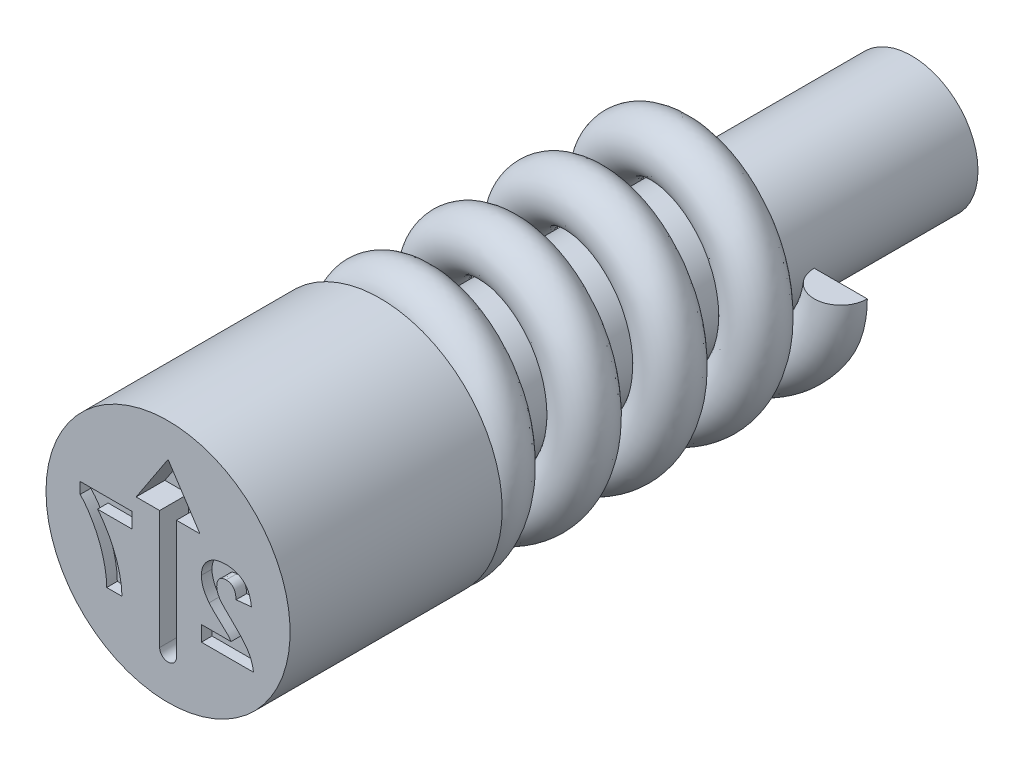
ISO-10303-21;
HEADER;
FILE_DESCRIPTION(('STEP AP214'),'2;1');
FILE_NAME('part.step','',(''),(''),'','','');
FILE_SCHEMA(('AUTOMOTIVE_DESIGN { 1 0 10303 214 1 1 1 1 }'));
ENDSEC;
DATA;
#1=APPLICATION_CONTEXT('core data for automotive mechanical design processes');
#2=APPLICATION_PROTOCOL_DEFINITION('international standard','automotive_design',2000,#1);
#3=PRODUCT_CONTEXT('',#1,'mechanical');
#4=PRODUCT('Part','Part','',(#3));
#5=PRODUCT_RELATED_PRODUCT_CATEGORY('part','',(#4));
#6=PRODUCT_DEFINITION_FORMATION('','',#4);
#7=PRODUCT_DEFINITION_CONTEXT('part definition',#1,'design');
#8=PRODUCT_DEFINITION('design','',#6,#7);
#9=PRODUCT_DEFINITION_SHAPE('','',#8);
#10=(LENGTH_UNIT() NAMED_UNIT(*) SI_UNIT(.MILLI.,.METRE.));
#11=(NAMED_UNIT(*) PLANE_ANGLE_UNIT() SI_UNIT($,.RADIAN.));
#12=(NAMED_UNIT(*) SI_UNIT($,.STERADIAN.) SOLID_ANGLE_UNIT());
#13=UNCERTAINTY_MEASURE_WITH_UNIT(LENGTH_MEASURE(1.E-05),#10,'distance_accuracy_value','');
#14=(GEOMETRIC_REPRESENTATION_CONTEXT(3) GLOBAL_UNCERTAINTY_ASSIGNED_CONTEXT((#13)) GLOBAL_UNIT_ASSIGNED_CONTEXT((#10,
#11,#12)) REPRESENTATION_CONTEXT('',''));
#15=CARTESIAN_POINT('',(0.,0.,0.));
#16=DIRECTION('',(0.,0.,1.));
#17=DIRECTION('',(1.,0.,0.));
#18=AXIS2_PLACEMENT_3D('',#15,#16,#17);
#19=CARTESIAN_POINT('',(1.8,0.,-11.3772));
#20=DIRECTION('',(0.,-1.,0.));
#21=DIRECTION('',(0.,0.,-1.));
#22=AXIS2_PLACEMENT_3D('',#19,#20,#21);
#23=PLANE('',#22);
#24=CARTESIAN_POINT('',(1.8,0.,-10.8772));
#25=DIRECTION('',(0.,1.,0.));
#26=DIRECTION('',(0.,0.,1.));
#27=AXIS2_PLACEMENT_3D('',#24,#25,#26);
#28=CIRCLE('',#27,0.5);
#29=CARTESIAN_POINT('',(1.3,0.,-10.8772));
#30=VERTEX_POINT('',#29);
#31=CARTESIAN_POINT('',(2.3,0.,-10.8772));
#32=VERTEX_POINT('',#31);
#33=EDGE_CURVE('E90',#30,#32,#28,.T.);
#34=ORIENTED_EDGE('',*,*,#33,.T.);
#35=DIRECTION('',(-1.,0.,0.));
#36=VECTOR('',#35,1.);
#37=CARTESIAN_POINT('',(1.8,0.,-10.8772));
#38=LINE('',#37,#36);
#39=EDGE_CURVE('E77',#32,#30,#38,.T.);
#40=ORIENTED_EDGE('',*,*,#39,.T.);
#41=EDGE_LOOP('',(#34,#40));
#42=FACE_BOUND('',#41,.T.);
#43=ADVANCED_FACE('F51',(#42),#23,.F.);
#44=CARTESIAN_POINT('',(0.,-1.8,-4.4972));
#45=DIRECTION('',(-1.,0.,0.));
#46=DIRECTION('',(0.,-1.,0.));
#47=AXIS2_PLACEMENT_3D('',#44,#45,#46);
#48=PLANE('',#47);
#49=DIRECTION('',(0.,-1.,0.));
#50=VECTOR('',#49,1.);
#51=CARTESIAN_POINT('',(0.,-1.8,-3.9972));
#52=LINE('',#51,#50);
#53=CARTESIAN_POINT('',(0.,-1.3,-3.9972));
#54=VERTEX_POINT('',#53);
#55=CARTESIAN_POINT('',(0.,-2.3,-3.9972));
#56=VERTEX_POINT('',#55);
#57=EDGE_CURVE('E71',#54,#56,#52,.T.);
#58=ORIENTED_EDGE('',*,*,#57,.F.);
#59=CARTESIAN_POINT('',(0.,-1.8,-3.9972));
#60=DIRECTION('',(-1.,0.,0.));
#61=DIRECTION('',(0.,-1.,0.));
#62=AXIS2_PLACEMENT_3D('',#59,#60,#61);
#63=CIRCLE('',#62,0.5);
#64=EDGE_CURVE('E87',#54,#56,#63,.T.);
#65=ORIENTED_EDGE('',*,*,#64,.T.);
#66=EDGE_LOOP('',(#58,#65));
#67=FACE_BOUND('',#66,.T.);
#68=ADVANCED_FACE('F53',(#67),#48,.T.);
#69=CARTESIAN_POINT('',(1.8,0.,-10.3772));
#70=CARTESIAN_POINT('',(1.8,-0.745584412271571,-10.2760235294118));
#71=CARTESIAN_POINT('',(1.27279220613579,-1.27279220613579,-10.1748470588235));
#72=CARTESIAN_POINT('',(0.745584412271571,-1.8,-10.0736705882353));
#73=CARTESIAN_POINT('',(0.,-1.8,-9.97249411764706));
#74=CARTESIAN_POINT('',(-0.745584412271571,-1.8,-9.87131764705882));
#75=CARTESIAN_POINT('',(-1.27279220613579,-1.27279220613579,-9.77014117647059));
#76=CARTESIAN_POINT('',(-1.8,-0.745584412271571,-9.66896470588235));
#77=CARTESIAN_POINT('',(-1.8,0.,-9.56778823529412));
#78=CARTESIAN_POINT('',(-1.8,0.745584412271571,-9.46661176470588));
#79=CARTESIAN_POINT('',(-1.27279220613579,1.27279220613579,-9.36543529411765));
#80=CARTESIAN_POINT('',(-0.745584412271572,1.8,-9.26425882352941));
#81=CARTESIAN_POINT('',(0.,1.8,-9.16308235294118));
#82=CARTESIAN_POINT('',(0.745584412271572,1.8,-9.06190588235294));
#83=CARTESIAN_POINT('',(1.27279220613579,1.27279220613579,-8.96072941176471));
#84=CARTESIAN_POINT('',(1.8,0.745584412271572,-8.85955294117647));
#85=CARTESIAN_POINT('',(1.8,0.,-8.75837647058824));
#86=CARTESIAN_POINT('',(1.8,-0.745584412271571,-8.6572));
#87=CARTESIAN_POINT('',(1.27279220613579,-1.27279220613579,-8.55602352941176));
#88=CARTESIAN_POINT('',(0.745584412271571,-1.8,-8.45484705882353));
#89=CARTESIAN_POINT('',(0.,-1.8,-8.35367058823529));
#90=CARTESIAN_POINT('',(-0.745584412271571,-1.8,-8.25249411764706));
#91=CARTESIAN_POINT('',(-1.27279220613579,-1.27279220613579,-8.15131764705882));
#92=CARTESIAN_POINT('',(-1.8,-0.745584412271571,-8.05014117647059));
#93=CARTESIAN_POINT('',(-1.8,0.,-7.94896470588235));
#94=CARTESIAN_POINT('',(-1.8,0.745584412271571,-7.84778823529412));
#95=CARTESIAN_POINT('',(-1.27279220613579,1.27279220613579,-7.74661176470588));
#96=CARTESIAN_POINT('',(-0.745584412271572,1.8,-7.64543529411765));
#97=CARTESIAN_POINT('',(0.,1.8,-7.54425882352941));
#98=CARTESIAN_POINT('',(0.745584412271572,1.8,-7.44308235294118));
#99=CARTESIAN_POINT('',(1.27279220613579,1.27279220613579,-7.34190588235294));
#100=CARTESIAN_POINT('',(1.8,0.745584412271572,-7.2407294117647));
#101=CARTESIAN_POINT('',(1.8,0.,-7.13955294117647));
#102=CARTESIAN_POINT('',(1.8,-0.745584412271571,-7.03837647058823));
#103=CARTESIAN_POINT('',(1.27279220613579,-1.27279220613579,-6.9372));
#104=CARTESIAN_POINT('',(0.745584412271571,-1.8,-6.83602352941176));
#105=CARTESIAN_POINT('',(0.,-1.8,-6.73484705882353));
#106=CARTESIAN_POINT('',(-0.745584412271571,-1.8,-6.63367058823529));
#107=CARTESIAN_POINT('',(-1.27279220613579,-1.27279220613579,-6.53249411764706));
#108=CARTESIAN_POINT('',(-1.8,-0.745584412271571,-6.43131764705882));
#109=CARTESIAN_POINT('',(-1.8,0.,-6.33014117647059));
#110=CARTESIAN_POINT('',(-1.8,0.745584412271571,-6.22896470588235));
#111=CARTESIAN_POINT('',(-1.27279220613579,1.27279220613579,-6.12778823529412));
#112=CARTESIAN_POINT('',(-0.745584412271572,1.8,-6.02661176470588));
#113=CARTESIAN_POINT('',(0.,1.8,-5.92543529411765));
#114=CARTESIAN_POINT('',(0.745584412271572,1.8,-5.82425882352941));
#115=CARTESIAN_POINT('',(1.27279220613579,1.27279220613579,-5.72308235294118));
#116=CARTESIAN_POINT('',(1.8,0.745584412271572,-5.62190588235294));
#117=CARTESIAN_POINT('',(1.8,0.,-5.52072941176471));
#118=CARTESIAN_POINT('',(1.8,-0.745584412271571,-5.41955294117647));
#119=CARTESIAN_POINT('',(1.27279220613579,-1.27279220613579,-5.31837647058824));
#120=CARTESIAN_POINT('',(0.745584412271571,-1.8,-5.2172));
#121=CARTESIAN_POINT('',(0.,-1.8,-5.11602352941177));
#122=CARTESIAN_POINT('',(-0.745584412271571,-1.8,-5.01484705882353));
#123=CARTESIAN_POINT('',(-1.27279220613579,-1.27279220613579,-4.91367058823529));
#124=CARTESIAN_POINT('',(-1.8,-0.745584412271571,-4.81249411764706));
#125=CARTESIAN_POINT('',(-1.8,0.,-4.71131764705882));
#126=CARTESIAN_POINT('',(-1.8,0.745584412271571,-4.61014117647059));
#127=CARTESIAN_POINT('',(-1.27279220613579,1.27279220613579,-4.50896470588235));
#128=CARTESIAN_POINT('',(-0.745584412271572,1.8,-4.40778823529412));
#129=CARTESIAN_POINT('',(0.,1.8,-4.30661176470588));
#130=CARTESIAN_POINT('',(0.745584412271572,1.8,-4.20543529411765));
#131=CARTESIAN_POINT('',(1.27279220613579,1.27279220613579,-4.10425882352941));
#132=CARTESIAN_POINT('',(1.8,0.745584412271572,-4.00308235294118));
#133=CARTESIAN_POINT('',(1.8,0.,-3.90190588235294));
#134=CARTESIAN_POINT('',(1.8,-0.745584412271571,-3.80072941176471));
#135=CARTESIAN_POINT('',(1.27279220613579,-1.27279220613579,-3.69955294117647));
#136=CARTESIAN_POINT('',(0.745584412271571,-1.8,-3.59837647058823));
#137=CARTESIAN_POINT('',(0.,-1.8,-3.4972));
#138=CARTESIAN_POINT('',(2.8,0.,-10.3772));
#139=CARTESIAN_POINT('',(2.8,-1.15979797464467,-10.2760235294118));
#140=CARTESIAN_POINT('',(1.97989898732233,-1.97989898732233,-10.1748470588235));
#141=CARTESIAN_POINT('',(1.15979797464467,-2.8,-10.0736705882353));
#142=CARTESIAN_POINT('',(0.,-2.8,-9.97249411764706));
#143=CARTESIAN_POINT('',(-1.15979797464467,-2.8,-9.87131764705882));
#144=CARTESIAN_POINT('',(-1.97989898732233,-1.97989898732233,-9.77014117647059));
#145=CARTESIAN_POINT('',(-2.8,-1.15979797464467,-9.66896470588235));
#146=CARTESIAN_POINT('',(-2.8,0.,-9.56778823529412));
#147=CARTESIAN_POINT('',(-2.8,1.15979797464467,-9.46661176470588));
#148=CARTESIAN_POINT('',(-1.97989898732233,1.97989898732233,-9.36543529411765));
#149=CARTESIAN_POINT('',(-1.15979797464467,2.8,-9.26425882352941));
#150=CARTESIAN_POINT('',(0.,2.8,-9.16308235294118));
#151=CARTESIAN_POINT('',(1.15979797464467,2.8,-9.06190588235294));
#152=CARTESIAN_POINT('',(1.97989898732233,1.97989898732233,-8.96072941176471));
#153=CARTESIAN_POINT('',(2.8,1.15979797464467,-8.85955294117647));
#154=CARTESIAN_POINT('',(2.8,0.,-8.75837647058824));
#155=CARTESIAN_POINT('',(2.8,-1.15979797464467,-8.6572));
#156=CARTESIAN_POINT('',(1.97989898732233,-1.97989898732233,-8.55602352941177));
#157=CARTESIAN_POINT('',(1.15979797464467,-2.8,-8.45484705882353));
#158=CARTESIAN_POINT('',(0.,-2.8,-8.35367058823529));
#159=CARTESIAN_POINT('',(-1.15979797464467,-2.8,-8.25249411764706));
#160=CARTESIAN_POINT('',(-1.97989898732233,-1.97989898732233,-8.15131764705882));
#161=CARTESIAN_POINT('',(-2.8,-1.15979797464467,-8.05014117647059));
#162=CARTESIAN_POINT('',(-2.8,0.,-7.94896470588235));
#163=CARTESIAN_POINT('',(-2.8,1.15979797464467,-7.84778823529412));
#164=CARTESIAN_POINT('',(-1.97989898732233,1.97989898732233,-7.74661176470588));
#165=CARTESIAN_POINT('',(-1.15979797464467,2.8,-7.64543529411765));
#166=CARTESIAN_POINT('',(0.,2.8,-7.54425882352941));
#167=CARTESIAN_POINT('',(1.15979797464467,2.8,-7.44308235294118));
#168=CARTESIAN_POINT('',(1.97989898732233,1.97989898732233,-7.34190588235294));
#169=CARTESIAN_POINT('',(2.8,1.15979797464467,-7.24072941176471));
#170=CARTESIAN_POINT('',(2.8,0.,-7.13955294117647));
#171=CARTESIAN_POINT('',(2.8,-1.15979797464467,-7.03837647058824));
#172=CARTESIAN_POINT('',(1.97989898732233,-1.97989898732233,-6.9372));
#173=CARTESIAN_POINT('',(1.15979797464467,-2.8,-6.83602352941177));
#174=CARTESIAN_POINT('',(0.,-2.8,-6.73484705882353));
#175=CARTESIAN_POINT('',(-1.15979797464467,-2.8,-6.63367058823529));
#176=CARTESIAN_POINT('',(-1.97989898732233,-1.97989898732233,-6.53249411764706));
#177=CARTESIAN_POINT('',(-2.8,-1.15979797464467,-6.43131764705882));
#178=CARTESIAN_POINT('',(-2.8,0.,-6.33014117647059));
#179=CARTESIAN_POINT('',(-2.8,1.15979797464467,-6.22896470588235));
#180=CARTESIAN_POINT('',(-1.97989898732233,1.97989898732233,-6.12778823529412));
#181=CARTESIAN_POINT('',(-1.15979797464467,2.8,-6.02661176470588));
#182=CARTESIAN_POINT('',(0.,2.8,-5.92543529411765));
#183=CARTESIAN_POINT('',(1.15979797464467,2.8,-5.82425882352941));
#184=CARTESIAN_POINT('',(1.97989898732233,1.97989898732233,-5.72308235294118));
#185=CARTESIAN_POINT('',(2.8,1.15979797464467,-5.62190588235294));
#186=CARTESIAN_POINT('',(2.8,0.,-5.52072941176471));
#187=CARTESIAN_POINT('',(2.8,-1.15979797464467,-5.41955294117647));
#188=CARTESIAN_POINT('',(1.97989898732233,-1.97989898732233,-5.31837647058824));
#189=CARTESIAN_POINT('',(1.15979797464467,-2.8,-5.2172));
#190=CARTESIAN_POINT('',(0.,-2.8,-5.11602352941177));
#191=CARTESIAN_POINT('',(-1.15979797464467,-2.8,-5.01484705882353));
#192=CARTESIAN_POINT('',(-1.97989898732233,-1.97989898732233,-4.91367058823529));
#193=CARTESIAN_POINT('',(-2.8,-1.15979797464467,-4.81249411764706));
#194=CARTESIAN_POINT('',(-2.8,0.,-4.71131764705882));
#195=CARTESIAN_POINT('',(-2.8,1.15979797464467,-4.61014117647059));
#196=CARTESIAN_POINT('',(-1.97989898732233,1.97989898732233,-4.50896470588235));
#197=CARTESIAN_POINT('',(-1.15979797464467,2.8,-4.40778823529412));
#198=CARTESIAN_POINT('',(0.,2.8,-4.30661176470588));
#199=CARTESIAN_POINT('',(1.15979797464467,2.8,-4.20543529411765));
#200=CARTESIAN_POINT('',(1.97989898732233,1.97989898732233,-4.10425882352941));
#201=CARTESIAN_POINT('',(2.8,1.15979797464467,-4.00308235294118));
#202=CARTESIAN_POINT('',(2.8,0.,-3.90190588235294));
#203=CARTESIAN_POINT('',(2.8,-1.15979797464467,-3.80072941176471));
#204=CARTESIAN_POINT('',(1.97989898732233,-1.97989898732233,-3.69955294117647));
#205=CARTESIAN_POINT('',(1.15979797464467,-2.8,-3.59837647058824));
#206=CARTESIAN_POINT('',(0.,-2.8,-3.4972));
#207=CARTESIAN_POINT('',(2.8,0.,-11.3772));
#208=CARTESIAN_POINT('',(2.8,-1.15979797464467,-11.2760235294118));
#209=CARTESIAN_POINT('',(1.97989898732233,-1.97989898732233,-11.1748470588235));
#210=CARTESIAN_POINT('',(1.15979797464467,-2.8,-11.0736705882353));
#211=CARTESIAN_POINT('',(0.,-2.8,-10.9724941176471));
#212=CARTESIAN_POINT('',(-1.15979797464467,-2.8,-10.8713176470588));
#213=CARTESIAN_POINT('',(-1.97989898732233,-1.97989898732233,-10.7701411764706));
#214=CARTESIAN_POINT('',(-2.8,-1.15979797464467,-10.6689647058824));
#215=CARTESIAN_POINT('',(-2.8,0.,-10.5677882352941));
#216=CARTESIAN_POINT('',(-2.8,1.15979797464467,-10.4666117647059));
#217=CARTESIAN_POINT('',(-1.97989898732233,1.97989898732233,-10.3654352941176));
#218=CARTESIAN_POINT('',(-1.15979797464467,2.8,-10.2642588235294));
#219=CARTESIAN_POINT('',(0.,2.8,-10.1630823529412));
#220=CARTESIAN_POINT('',(1.15979797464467,2.8,-10.0619058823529));
#221=CARTESIAN_POINT('',(1.97989898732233,1.97989898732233,-9.96072941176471));
#222=CARTESIAN_POINT('',(2.8,1.15979797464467,-9.85955294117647));
#223=CARTESIAN_POINT('',(2.8,0.,-9.75837647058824));
#224=CARTESIAN_POINT('',(2.8,-1.15979797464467,-9.6572));
#225=CARTESIAN_POINT('',(1.97989898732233,-1.97989898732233,-9.55602352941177));
#226=CARTESIAN_POINT('',(1.15979797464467,-2.8,-9.45484705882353));
#227=CARTESIAN_POINT('',(0.,-2.8,-9.35367058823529));
#228=CARTESIAN_POINT('',(-1.15979797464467,-2.8,-9.25249411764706));
#229=CARTESIAN_POINT('',(-1.97989898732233,-1.97989898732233,-9.15131764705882));
#230=CARTESIAN_POINT('',(-2.8,-1.15979797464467,-9.05014117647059));
#231=CARTESIAN_POINT('',(-2.8,0.,-8.94896470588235));
#232=CARTESIAN_POINT('',(-2.8,1.15979797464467,-8.84778823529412));
#233=CARTESIAN_POINT('',(-1.97989898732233,1.97989898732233,-8.74661176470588));
#234=CARTESIAN_POINT('',(-1.15979797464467,2.8,-8.64543529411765));
#235=CARTESIAN_POINT('',(0.,2.8,-8.54425882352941));
#236=CARTESIAN_POINT('',(1.15979797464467,2.8,-8.44308235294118));
#237=CARTESIAN_POINT('',(1.97989898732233,1.97989898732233,-8.34190588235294));
#238=CARTESIAN_POINT('',(2.8,1.15979797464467,-8.24072941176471));
#239=CARTESIAN_POINT('',(2.8,0.,-8.13955294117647));
#240=CARTESIAN_POINT('',(2.8,-1.15979797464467,-8.03837647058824));
#241=CARTESIAN_POINT('',(1.97989898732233,-1.97989898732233,-7.9372));
#242=CARTESIAN_POINT('',(1.15979797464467,-2.8,-7.83602352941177));
#243=CARTESIAN_POINT('',(0.,-2.8,-7.73484705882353));
#244=CARTESIAN_POINT('',(-1.15979797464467,-2.8,-7.63367058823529));
#245=CARTESIAN_POINT('',(-1.97989898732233,-1.97989898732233,-7.53249411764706));
#246=CARTESIAN_POINT('',(-2.8,-1.15979797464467,-7.43131764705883));
#247=CARTESIAN_POINT('',(-2.8,0.,-7.33014117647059));
#248=CARTESIAN_POINT('',(-2.8,1.15979797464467,-7.22896470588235));
#249=CARTESIAN_POINT('',(-1.97989898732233,1.97989898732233,-7.12778823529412));
#250=CARTESIAN_POINT('',(-1.15979797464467,2.8,-7.02661176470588));
#251=CARTESIAN_POINT('',(0.,2.8,-6.92543529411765));
#252=CARTESIAN_POINT('',(1.15979797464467,2.8,-6.82425882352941));
#253=CARTESIAN_POINT('',(1.97989898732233,1.97989898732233,-6.72308235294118));
#254=CARTESIAN_POINT('',(2.8,1.15979797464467,-6.62190588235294));
#255=CARTESIAN_POINT('',(2.8,0.,-6.52072941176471));
#256=CARTESIAN_POINT('',(2.8,-1.15979797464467,-6.41955294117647));
#257=CARTESIAN_POINT('',(1.97989898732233,-1.97989898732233,-6.31837647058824));
#258=CARTESIAN_POINT('',(1.15979797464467,-2.8,-6.2172));
#259=CARTESIAN_POINT('',(0.,-2.8,-6.11602352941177));
#260=CARTESIAN_POINT('',(-1.15979797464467,-2.8,-6.01484705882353));
#261=CARTESIAN_POINT('',(-1.97989898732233,-1.97989898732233,-5.9136705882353));
#262=CARTESIAN_POINT('',(-2.8,-1.15979797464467,-5.81249411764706));
#263=CARTESIAN_POINT('',(-2.8,0.,-5.71131764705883));
#264=CARTESIAN_POINT('',(-2.8,1.15979797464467,-5.61014117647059));
#265=CARTESIAN_POINT('',(-1.97989898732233,1.97989898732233,-5.50896470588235));
#266=CARTESIAN_POINT('',(-1.15979797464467,2.8,-5.40778823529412));
#267=CARTESIAN_POINT('',(0.,2.8,-5.30661176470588));
#268=CARTESIAN_POINT('',(1.15979797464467,2.8,-5.20543529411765));
#269=CARTESIAN_POINT('',(1.97989898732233,1.97989898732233,-5.10425882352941));
#270=CARTESIAN_POINT('',(2.8,1.15979797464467,-5.00308235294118));
#271=CARTESIAN_POINT('',(2.8,0.,-4.90190588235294));
#272=CARTESIAN_POINT('',(2.8,-1.15979797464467,-4.80072941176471));
#273=CARTESIAN_POINT('',(1.97989898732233,-1.97989898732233,-4.69955294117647));
#274=CARTESIAN_POINT('',(1.15979797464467,-2.8,-4.59837647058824));
#275=CARTESIAN_POINT('',(0.,-2.8,-4.4972));
#276=CARTESIAN_POINT('',(1.8,0.,-11.3772));
#277=CARTESIAN_POINT('',(1.8,-0.745584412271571,-11.2760235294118));
#278=CARTESIAN_POINT('',(1.27279220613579,-1.27279220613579,-11.1748470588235));
#279=CARTESIAN_POINT('',(0.745584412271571,-1.8,-11.0736705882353));
#280=CARTESIAN_POINT('',(0.,-1.8,-10.9724941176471));
#281=CARTESIAN_POINT('',(-0.745584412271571,-1.8,-10.8713176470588));
#282=CARTESIAN_POINT('',(-1.27279220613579,-1.27279220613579,-10.7701411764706));
#283=CARTESIAN_POINT('',(-1.8,-0.745584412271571,-10.6689647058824));
#284=CARTESIAN_POINT('',(-1.8,0.,-10.5677882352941));
#285=CARTESIAN_POINT('',(-1.8,0.745584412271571,-10.4666117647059));
#286=CARTESIAN_POINT('',(-1.27279220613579,1.27279220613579,-10.3654352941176));
#287=CARTESIAN_POINT('',(-0.745584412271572,1.8,-10.2642588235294));
#288=CARTESIAN_POINT('',(0.,1.8,-10.1630823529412));
#289=CARTESIAN_POINT('',(0.745584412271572,1.8,-10.0619058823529));
#290=CARTESIAN_POINT('',(1.27279220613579,1.27279220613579,-9.96072941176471));
#291=CARTESIAN_POINT('',(1.8,0.745584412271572,-9.85955294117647));
#292=CARTESIAN_POINT('',(1.8,0.,-9.75837647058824));
#293=CARTESIAN_POINT('',(1.8,-0.745584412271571,-9.6572));
#294=CARTESIAN_POINT('',(1.27279220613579,-1.27279220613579,-9.55602352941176));
#295=CARTESIAN_POINT('',(0.745584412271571,-1.8,-9.45484705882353));
#296=CARTESIAN_POINT('',(0.,-1.8,-9.35367058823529));
#297=CARTESIAN_POINT('',(-0.745584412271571,-1.8,-9.25249411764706));
#298=CARTESIAN_POINT('',(-1.27279220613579,-1.27279220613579,-9.15131764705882));
#299=CARTESIAN_POINT('',(-1.8,-0.745584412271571,-9.05014117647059));
#300=CARTESIAN_POINT('',(-1.8,0.,-8.94896470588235));
#301=CARTESIAN_POINT('',(-1.8,0.745584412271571,-8.84778823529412));
#302=CARTESIAN_POINT('',(-1.27279220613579,1.27279220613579,-8.74661176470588));
#303=CARTESIAN_POINT('',(-0.745584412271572,1.8,-8.64543529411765));
#304=CARTESIAN_POINT('',(0.,1.8,-8.54425882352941));
#305=CARTESIAN_POINT('',(0.745584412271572,1.8,-8.44308235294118));
#306=CARTESIAN_POINT('',(1.27279220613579,1.27279220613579,-8.34190588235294));
#307=CARTESIAN_POINT('',(1.8,0.745584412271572,-8.24072941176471));
#308=CARTESIAN_POINT('',(1.8,0.,-8.13955294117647));
#309=CARTESIAN_POINT('',(1.8,-0.745584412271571,-8.03837647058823));
#310=CARTESIAN_POINT('',(1.27279220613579,-1.27279220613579,-7.9372));
#311=CARTESIAN_POINT('',(0.745584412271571,-1.8,-7.83602352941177));
#312=CARTESIAN_POINT('',(0.,-1.8,-7.73484705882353));
#313=CARTESIAN_POINT('',(-0.745584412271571,-1.8,-7.63367058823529));
#314=CARTESIAN_POINT('',(-1.27279220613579,-1.27279220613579,-7.53249411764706));
#315=CARTESIAN_POINT('',(-1.8,-0.745584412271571,-7.43131764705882));
#316=CARTESIAN_POINT('',(-1.8,0.,-7.33014117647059));
#317=CARTESIAN_POINT('',(-1.8,0.745584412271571,-7.22896470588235));
#318=CARTESIAN_POINT('',(-1.27279220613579,1.27279220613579,-7.12778823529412));
#319=CARTESIAN_POINT('',(-0.745584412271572,1.8,-7.02661176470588));
#320=CARTESIAN_POINT('',(0.,1.8,-6.92543529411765));
#321=CARTESIAN_POINT('',(0.745584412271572,1.8,-6.82425882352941));
#322=CARTESIAN_POINT('',(1.27279220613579,1.27279220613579,-6.72308235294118));
#323=CARTESIAN_POINT('',(1.8,0.745584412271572,-6.62190588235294));
#324=CARTESIAN_POINT('',(1.8,0.,-6.52072941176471));
#325=CARTESIAN_POINT('',(1.8,-0.745584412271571,-6.41955294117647));
#326=CARTESIAN_POINT('',(1.27279220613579,-1.27279220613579,-6.31837647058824));
#327=CARTESIAN_POINT('',(0.745584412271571,-1.8,-6.2172));
#328=CARTESIAN_POINT('',(0.,-1.8,-6.11602352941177));
#329=CARTESIAN_POINT('',(-0.745584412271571,-1.8,-6.01484705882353));
#330=CARTESIAN_POINT('',(-1.27279220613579,-1.27279220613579,-5.91367058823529));
#331=CARTESIAN_POINT('',(-1.8,-0.745584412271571,-5.81249411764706));
#332=CARTESIAN_POINT('',(-1.8,0.,-5.71131764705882));
#333=CARTESIAN_POINT('',(-1.8,0.745584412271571,-5.61014117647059));
#334=CARTESIAN_POINT('',(-1.27279220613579,1.27279220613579,-5.50896470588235));
#335=CARTESIAN_POINT('',(-0.745584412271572,1.8,-5.40778823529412));
#336=CARTESIAN_POINT('',(0.,1.8,-5.30661176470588));
#337=CARTESIAN_POINT('',(0.745584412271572,1.8,-5.20543529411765));
#338=CARTESIAN_POINT('',(1.27279220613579,1.27279220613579,-5.10425882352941));
#339=CARTESIAN_POINT('',(1.8,0.745584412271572,-5.00308235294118));
#340=CARTESIAN_POINT('',(1.8,0.,-4.90190588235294));
#341=CARTESIAN_POINT('',(1.8,-0.745584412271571,-4.80072941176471));
#342=CARTESIAN_POINT('',(1.27279220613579,-1.27279220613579,-4.69955294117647));
#343=CARTESIAN_POINT('',(0.745584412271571,-1.8,-4.59837647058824));
#344=CARTESIAN_POINT('',(0.,-1.8,-4.4972));
#345=CARTESIAN_POINT('',(0.799999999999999,0.,-11.3772));
#346=CARTESIAN_POINT('',(0.8,-0.331370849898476,-11.2760235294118));
#347=CARTESIAN_POINT('',(0.565685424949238,-0.565685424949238,-11.1748470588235));
#348=CARTESIAN_POINT('',(0.331370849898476,-0.8,-11.0736705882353));
#349=CARTESIAN_POINT('',(0.,-0.799999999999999,-10.9724941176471));
#350=CARTESIAN_POINT('',(-0.331370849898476,-0.8,-10.8713176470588));
#351=CARTESIAN_POINT('',(-0.565685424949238,-0.565685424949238,-10.7701411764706));
#352=CARTESIAN_POINT('',(-0.8,-0.331370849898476,-10.6689647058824));
#353=CARTESIAN_POINT('',(-0.799999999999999,0.,-10.5677882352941));
#354=CARTESIAN_POINT('',(-0.8,0.331370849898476,-10.4666117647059));
#355=CARTESIAN_POINT('',(-0.565685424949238,0.565685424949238,-10.3654352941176));
#356=CARTESIAN_POINT('',(-0.331370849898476,0.799999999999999,-10.2642588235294));
#357=CARTESIAN_POINT('',(0.,0.799999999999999,-10.1630823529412));
#358=CARTESIAN_POINT('',(0.331370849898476,0.8,-10.0619058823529));
#359=CARTESIAN_POINT('',(0.565685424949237,0.565685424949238,-9.96072941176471));
#360=CARTESIAN_POINT('',(0.799999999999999,0.331370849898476,-9.85955294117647));
#361=CARTESIAN_POINT('',(0.799999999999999,0.,-9.75837647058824));
#362=CARTESIAN_POINT('',(0.8,-0.331370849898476,-9.6572));
#363=CARTESIAN_POINT('',(0.565685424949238,-0.565685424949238,-9.55602352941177));
#364=CARTESIAN_POINT('',(0.331370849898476,-0.8,-9.45484705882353));
#365=CARTESIAN_POINT('',(0.,-0.799999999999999,-9.35367058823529));
#366=CARTESIAN_POINT('',(-0.331370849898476,-0.8,-9.25249411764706));
#367=CARTESIAN_POINT('',(-0.565685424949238,-0.565685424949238,-9.15131764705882));
#368=CARTESIAN_POINT('',(-0.8,-0.331370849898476,-9.05014117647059));
#369=CARTESIAN_POINT('',(-0.799999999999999,0.,-8.94896470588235));
#370=CARTESIAN_POINT('',(-0.8,0.331370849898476,-8.84778823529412));
#371=CARTESIAN_POINT('',(-0.565685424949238,0.565685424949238,-8.74661176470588));
#372=CARTESIAN_POINT('',(-0.331370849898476,0.799999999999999,-8.64543529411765));
#373=CARTESIAN_POINT('',(0.,0.799999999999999,-8.54425882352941));
#374=CARTESIAN_POINT('',(0.331370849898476,0.8,-8.44308235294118));
#375=CARTESIAN_POINT('',(0.565685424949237,0.565685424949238,-8.34190588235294));
#376=CARTESIAN_POINT('',(0.799999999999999,0.331370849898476,-8.24072941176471));
#377=CARTESIAN_POINT('',(0.799999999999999,0.,-8.13955294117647));
#378=CARTESIAN_POINT('',(0.8,-0.331370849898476,-8.03837647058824));
#379=CARTESIAN_POINT('',(0.565685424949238,-0.565685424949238,-7.9372));
#380=CARTESIAN_POINT('',(0.331370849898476,-0.8,-7.83602352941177));
#381=CARTESIAN_POINT('',(0.,-0.799999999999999,-7.73484705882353));
#382=CARTESIAN_POINT('',(-0.331370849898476,-0.8,-7.63367058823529));
#383=CARTESIAN_POINT('',(-0.565685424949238,-0.565685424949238,-7.53249411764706));
#384=CARTESIAN_POINT('',(-0.8,-0.331370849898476,-7.43131764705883));
#385=CARTESIAN_POINT('',(-0.799999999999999,0.,-7.33014117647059));
#386=CARTESIAN_POINT('',(-0.8,0.331370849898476,-7.22896470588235));
#387=CARTESIAN_POINT('',(-0.565685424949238,0.565685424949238,-7.12778823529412));
#388=CARTESIAN_POINT('',(-0.331370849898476,0.799999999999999,-7.02661176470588));
#389=CARTESIAN_POINT('',(0.,0.799999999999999,-6.92543529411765));
#390=CARTESIAN_POINT('',(0.331370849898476,0.8,-6.82425882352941));
#391=CARTESIAN_POINT('',(0.565685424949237,0.565685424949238,-6.72308235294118));
#392=CARTESIAN_POINT('',(0.799999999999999,0.331370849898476,-6.62190588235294));
#393=CARTESIAN_POINT('',(0.799999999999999,0.,-6.52072941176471));
#394=CARTESIAN_POINT('',(0.8,-0.331370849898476,-6.41955294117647));
#395=CARTESIAN_POINT('',(0.565685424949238,-0.565685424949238,-6.31837647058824));
#396=CARTESIAN_POINT('',(0.331370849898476,-0.8,-6.2172));
#397=CARTESIAN_POINT('',(0.,-0.799999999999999,-6.11602352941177));
#398=CARTESIAN_POINT('',(-0.331370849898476,-0.8,-6.01484705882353));
#399=CARTESIAN_POINT('',(-0.565685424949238,-0.565685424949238,-5.9136705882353));
#400=CARTESIAN_POINT('',(-0.8,-0.331370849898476,-5.81249411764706));
#401=CARTESIAN_POINT('',(-0.799999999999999,0.,-5.71131764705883));
#402=CARTESIAN_POINT('',(-0.8,0.331370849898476,-5.61014117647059));
#403=CARTESIAN_POINT('',(-0.565685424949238,0.565685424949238,-5.50896470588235));
#404=CARTESIAN_POINT('',(-0.331370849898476,0.799999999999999,-5.40778823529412));
#405=CARTESIAN_POINT('',(0.,0.799999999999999,-5.30661176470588));
#406=CARTESIAN_POINT('',(0.331370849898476,0.8,-5.20543529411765));
#407=CARTESIAN_POINT('',(0.565685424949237,0.565685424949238,-5.10425882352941));
#408=CARTESIAN_POINT('',(0.799999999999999,0.331370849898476,-5.00308235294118));
#409=CARTESIAN_POINT('',(0.799999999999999,0.,-4.90190588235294));
#410=CARTESIAN_POINT('',(0.8,-0.331370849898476,-4.80072941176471));
#411=CARTESIAN_POINT('',(0.565685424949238,-0.565685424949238,-4.69955294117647));
#412=CARTESIAN_POINT('',(0.331370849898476,-0.8,-4.59837647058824));
#413=CARTESIAN_POINT('',(0.,-0.799999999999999,-4.4972));
#414=CARTESIAN_POINT('',(0.799999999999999,0.,-10.3772));
#415=CARTESIAN_POINT('',(0.8,-0.331370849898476,-10.2760235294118));
#416=CARTESIAN_POINT('',(0.565685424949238,-0.565685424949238,-10.1748470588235));
#417=CARTESIAN_POINT('',(0.331370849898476,-0.8,-10.0736705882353));
#418=CARTESIAN_POINT('',(0.,-0.799999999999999,-9.97249411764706));
#419=CARTESIAN_POINT('',(-0.331370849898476,-0.8,-9.87131764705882));
#420=CARTESIAN_POINT('',(-0.565685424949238,-0.565685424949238,-9.77014117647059));
#421=CARTESIAN_POINT('',(-0.8,-0.331370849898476,-9.66896470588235));
#422=CARTESIAN_POINT('',(-0.799999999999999,0.,-9.56778823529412));
#423=CARTESIAN_POINT('',(-0.8,0.331370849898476,-9.46661176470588));
#424=CARTESIAN_POINT('',(-0.565685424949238,0.565685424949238,-9.36543529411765));
#425=CARTESIAN_POINT('',(-0.331370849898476,0.799999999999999,-9.26425882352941));
#426=CARTESIAN_POINT('',(0.,0.799999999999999,-9.16308235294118));
#427=CARTESIAN_POINT('',(0.331370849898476,0.8,-9.06190588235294));
#428=CARTESIAN_POINT('',(0.565685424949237,0.565685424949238,-8.96072941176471));
#429=CARTESIAN_POINT('',(0.799999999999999,0.331370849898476,-8.85955294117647));
#430=CARTESIAN_POINT('',(0.799999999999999,0.,-8.75837647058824));
#431=CARTESIAN_POINT('',(0.8,-0.331370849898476,-8.6572));
#432=CARTESIAN_POINT('',(0.565685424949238,-0.565685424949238,-8.55602352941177));
#433=CARTESIAN_POINT('',(0.331370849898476,-0.8,-8.45484705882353));
#434=CARTESIAN_POINT('',(0.,-0.799999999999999,-8.35367058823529));
#435=CARTESIAN_POINT('',(-0.331370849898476,-0.8,-8.25249411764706));
#436=CARTESIAN_POINT('',(-0.565685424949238,-0.565685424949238,-8.15131764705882));
#437=CARTESIAN_POINT('',(-0.8,-0.331370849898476,-8.05014117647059));
#438=CARTESIAN_POINT('',(-0.799999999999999,0.,-7.94896470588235));
#439=CARTESIAN_POINT('',(-0.8,0.331370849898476,-7.84778823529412));
#440=CARTESIAN_POINT('',(-0.565685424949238,0.565685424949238,-7.74661176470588));
#441=CARTESIAN_POINT('',(-0.331370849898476,0.799999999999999,-7.64543529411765));
#442=CARTESIAN_POINT('',(0.,0.799999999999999,-7.54425882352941));
#443=CARTESIAN_POINT('',(0.331370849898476,0.8,-7.44308235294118));
#444=CARTESIAN_POINT('',(0.565685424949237,0.565685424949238,-7.34190588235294));
#445=CARTESIAN_POINT('',(0.799999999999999,0.331370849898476,-7.24072941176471));
#446=CARTESIAN_POINT('',(0.799999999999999,0.,-7.13955294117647));
#447=CARTESIAN_POINT('',(0.8,-0.331370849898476,-7.03837647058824));
#448=CARTESIAN_POINT('',(0.565685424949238,-0.565685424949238,-6.9372));
#449=CARTESIAN_POINT('',(0.331370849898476,-0.8,-6.83602352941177));
#450=CARTESIAN_POINT('',(0.,-0.799999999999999,-6.73484705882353));
#451=CARTESIAN_POINT('',(-0.331370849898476,-0.8,-6.63367058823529));
#452=CARTESIAN_POINT('',(-0.565685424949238,-0.565685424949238,-6.53249411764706));
#453=CARTESIAN_POINT('',(-0.8,-0.331370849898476,-6.43131764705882));
#454=CARTESIAN_POINT('',(-0.799999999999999,0.,-6.33014117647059));
#455=CARTESIAN_POINT('',(-0.8,0.331370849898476,-6.22896470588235));
#456=CARTESIAN_POINT('',(-0.565685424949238,0.565685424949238,-6.12778823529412));
#457=CARTESIAN_POINT('',(-0.331370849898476,0.799999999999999,-6.02661176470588));
#458=CARTESIAN_POINT('',(0.,0.799999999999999,-5.92543529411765));
#459=CARTESIAN_POINT('',(0.331370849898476,0.8,-5.82425882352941));
#460=CARTESIAN_POINT('',(0.565685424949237,0.565685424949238,-5.72308235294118));
#461=CARTESIAN_POINT('',(0.799999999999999,0.331370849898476,-5.62190588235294));
#462=CARTESIAN_POINT('',(0.799999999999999,0.,-5.52072941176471));
#463=CARTESIAN_POINT('',(0.8,-0.331370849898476,-5.41955294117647));
#464=CARTESIAN_POINT('',(0.565685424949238,-0.565685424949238,-5.31837647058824));
#465=CARTESIAN_POINT('',(0.331370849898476,-0.8,-5.2172));
#466=CARTESIAN_POINT('',(0.,-0.799999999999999,-5.11602352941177));
#467=CARTESIAN_POINT('',(-0.331370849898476,-0.8,-5.01484705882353));
#468=CARTESIAN_POINT('',(-0.565685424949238,-0.565685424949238,-4.91367058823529));
#469=CARTESIAN_POINT('',(-0.8,-0.331370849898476,-4.81249411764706));
#470=CARTESIAN_POINT('',(-0.799999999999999,0.,-4.71131764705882));
#471=CARTESIAN_POINT('',(-0.8,0.331370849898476,-4.61014117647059));
#472=CARTESIAN_POINT('',(-0.565685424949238,0.565685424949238,-4.50896470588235));
#473=CARTESIAN_POINT('',(-0.331370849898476,0.799999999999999,-4.40778823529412));
#474=CARTESIAN_POINT('',(0.,0.799999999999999,-4.30661176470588));
#475=CARTESIAN_POINT('',(0.331370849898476,0.8,-4.20543529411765));
#476=CARTESIAN_POINT('',(0.565685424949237,0.565685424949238,-4.10425882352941));
#477=CARTESIAN_POINT('',(0.799999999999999,0.331370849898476,-4.00308235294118));
#478=CARTESIAN_POINT('',(0.799999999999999,0.,-3.90190588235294));
#479=CARTESIAN_POINT('',(0.8,-0.331370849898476,-3.80072941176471));
#480=CARTESIAN_POINT('',(0.565685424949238,-0.565685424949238,-3.69955294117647));
#481=CARTESIAN_POINT('',(0.331370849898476,-0.8,-3.59837647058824));
#482=CARTESIAN_POINT('',(0.,-0.799999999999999,-3.4972));
#483=CARTESIAN_POINT('',(1.8,0.,-10.3772));
#484=CARTESIAN_POINT('',(1.8,-0.745584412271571,-10.2760235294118));
#485=CARTESIAN_POINT('',(1.27279220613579,-1.27279220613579,-10.1748470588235));
#486=CARTESIAN_POINT('',(0.745584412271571,-1.8,-10.0736705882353));
#487=CARTESIAN_POINT('',(0.,-1.8,-9.97249411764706));
#488=CARTESIAN_POINT('',(-0.745584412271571,-1.8,-9.87131764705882));
#489=CARTESIAN_POINT('',(-1.27279220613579,-1.27279220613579,-9.77014117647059));
#490=CARTESIAN_POINT('',(-1.8,-0.745584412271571,-9.66896470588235));
#491=CARTESIAN_POINT('',(-1.8,0.,-9.56778823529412));
#492=CARTESIAN_POINT('',(-1.8,0.745584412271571,-9.46661176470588));
#493=CARTESIAN_POINT('',(-1.27279220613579,1.27279220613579,-9.36543529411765));
#494=CARTESIAN_POINT('',(-0.745584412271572,1.8,-9.26425882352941));
#495=CARTESIAN_POINT('',(0.,1.8,-9.16308235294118));
#496=CARTESIAN_POINT('',(0.745584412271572,1.8,-9.06190588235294));
#497=CARTESIAN_POINT('',(1.27279220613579,1.27279220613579,-8.96072941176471));
#498=CARTESIAN_POINT('',(1.8,0.745584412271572,-8.85955294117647));
#499=CARTESIAN_POINT('',(1.8,0.,-8.75837647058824));
#500=CARTESIAN_POINT('',(1.8,-0.745584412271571,-8.6572));
#501=CARTESIAN_POINT('',(1.27279220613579,-1.27279220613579,-8.55602352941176));
#502=CARTESIAN_POINT('',(0.745584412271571,-1.8,-8.45484705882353));
#503=CARTESIAN_POINT('',(0.,-1.8,-8.35367058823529));
#504=CARTESIAN_POINT('',(-0.745584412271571,-1.8,-8.25249411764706));
#505=CARTESIAN_POINT('',(-1.27279220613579,-1.27279220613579,-8.15131764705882));
#506=CARTESIAN_POINT('',(-1.8,-0.745584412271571,-8.05014117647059));
#507=CARTESIAN_POINT('',(-1.8,0.,-7.94896470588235));
#508=CARTESIAN_POINT('',(-1.8,0.745584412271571,-7.84778823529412));
#509=CARTESIAN_POINT('',(-1.27279220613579,1.27279220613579,-7.74661176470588));
#510=CARTESIAN_POINT('',(-0.745584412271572,1.8,-7.64543529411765));
#511=CARTESIAN_POINT('',(0.,1.8,-7.54425882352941));
#512=CARTESIAN_POINT('',(0.745584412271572,1.8,-7.44308235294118));
#513=CARTESIAN_POINT('',(1.27279220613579,1.27279220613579,-7.34190588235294));
#514=CARTESIAN_POINT('',(1.8,0.745584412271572,-7.2407294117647));
#515=CARTESIAN_POINT('',(1.8,0.,-7.13955294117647));
#516=CARTESIAN_POINT('',(1.8,-0.745584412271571,-7.03837647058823));
#517=CARTESIAN_POINT('',(1.27279220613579,-1.27279220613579,-6.9372));
#518=CARTESIAN_POINT('',(0.745584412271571,-1.8,-6.83602352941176));
#519=CARTESIAN_POINT('',(0.,-1.8,-6.73484705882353));
#520=CARTESIAN_POINT('',(-0.745584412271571,-1.8,-6.63367058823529));
#521=CARTESIAN_POINT('',(-1.27279220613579,-1.27279220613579,-6.53249411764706));
#522=CARTESIAN_POINT('',(-1.8,-0.745584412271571,-6.43131764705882));
#523=CARTESIAN_POINT('',(-1.8,0.,-6.33014117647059));
#524=CARTESIAN_POINT('',(-1.8,0.745584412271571,-6.22896470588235));
#525=CARTESIAN_POINT('',(-1.27279220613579,1.27279220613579,-6.12778823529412));
#526=CARTESIAN_POINT('',(-0.745584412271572,1.8,-6.02661176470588));
#527=CARTESIAN_POINT('',(0.,1.8,-5.92543529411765));
#528=CARTESIAN_POINT('',(0.745584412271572,1.8,-5.82425882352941));
#529=CARTESIAN_POINT('',(1.27279220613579,1.27279220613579,-5.72308235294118));
#530=CARTESIAN_POINT('',(1.8,0.745584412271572,-5.62190588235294));
#531=CARTESIAN_POINT('',(1.8,0.,-5.52072941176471));
#532=CARTESIAN_POINT('',(1.8,-0.745584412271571,-5.41955294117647));
#533=CARTESIAN_POINT('',(1.27279220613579,-1.27279220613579,-5.31837647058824));
#534=CARTESIAN_POINT('',(0.745584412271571,-1.8,-5.2172));
#535=CARTESIAN_POINT('',(0.,-1.8,-5.11602352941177));
#536=CARTESIAN_POINT('',(-0.745584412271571,-1.8,-5.01484705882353));
#537=CARTESIAN_POINT('',(-1.27279220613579,-1.27279220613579,-4.91367058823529));
#538=CARTESIAN_POINT('',(-1.8,-0.745584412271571,-4.81249411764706));
#539=CARTESIAN_POINT('',(-1.8,0.,-4.71131764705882));
#540=CARTESIAN_POINT('',(-1.8,0.745584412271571,-4.61014117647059));
#541=CARTESIAN_POINT('',(-1.27279220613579,1.27279220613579,-4.50896470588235));
#542=CARTESIAN_POINT('',(-0.745584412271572,1.8,-4.40778823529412));
#543=CARTESIAN_POINT('',(0.,1.8,-4.30661176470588));
#544=CARTESIAN_POINT('',(0.745584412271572,1.8,-4.20543529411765));
#545=CARTESIAN_POINT('',(1.27279220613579,1.27279220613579,-4.10425882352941));
#546=CARTESIAN_POINT('',(1.8,0.745584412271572,-4.00308235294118));
#547=CARTESIAN_POINT('',(1.8,0.,-3.90190588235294));
#548=CARTESIAN_POINT('',(1.8,-0.745584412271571,-3.80072941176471));
#549=CARTESIAN_POINT('',(1.27279220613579,-1.27279220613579,-3.69955294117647));
#550=CARTESIAN_POINT('',(0.745584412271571,-1.8,-3.59837647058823));
#551=CARTESIAN_POINT('',(0.,-1.8,-3.4972));
#552=(BOUNDED_SURFACE() B_SPLINE_SURFACE(3,2,((#69,#70,#71,#72,#73,#74,#75,#76,#77,#78,#79,#80,
#81,#82,#83,#84,#85,#86,#87,#88,#89,#90,#91,#92,#93,#94,#95,#96,#97,#98,#99,#100,#101,#102,#103,
#104,#105,#106,#107,#108,#109,#110,#111,#112,#113,#114,#115,#116,#117,#118,#119,#120,#121,#122,
#123,#124,#125,#126,#127,#128,#129,#130,#131,#132,#133,#134,#135,#136,#137),(#138,#139,#140,
#141,#142,#143,#144,#145,#146,#147,#148,#149,#150,#151,#152,#153,#154,#155,#156,#157,#158,#159,
#160,#161,#162,#163,#164,#165,#166,#167,#168,#169,#170,#171,#172,#173,#174,#175,#176,#177,#178,
#179,#180,#181,#182,#183,#184,#185,#186,#187,#188,#189,#190,#191,#192,#193,#194,#195,#196,#197,
#198,#199,#200,#201,#202,#203,#204,#205,#206),(#207,#208,#209,#210,#211,#212,#213,#214,#215,
#216,#217,#218,#219,#220,#221,#222,#223,#224,#225,#226,#227,#228,#229,#230,#231,#232,#233,#234,
#235,#236,#237,#238,#239,#240,#241,#242,#243,#244,#245,#246,#247,#248,#249,#250,#251,#252,#253,
#254,#255,#256,#257,#258,#259,#260,#261,#262,#263,#264,#265,#266,#267,#268,#269,#270,#271,#272,
#273,#274,#275),(#276,#277,#278,#279,#280,#281,#282,#283,#284,#285,#286,#287,#288,#289,#290,
#291,#292,#293,#294,#295,#296,#297,#298,#299,#300,#301,#302,#303,#304,#305,#306,#307,#308,#309,
#310,#311,#312,#313,#314,#315,#316,#317,#318,#319,#320,#321,#322,#323,#324,#325,#326,#327,#328,
#329,#330,#331,#332,#333,#334,#335,#336,#337,#338,#339,#340,#341,#342,#343,#344),(#345,#346,
#347,#348,#349,#350,#351,#352,#353,#354,#355,#356,#357,#358,#359,#360,#361,#362,#363,#364,#365,
#366,#367,#368,#369,#370,#371,#372,#373,#374,#375,#376,#377,#378,#379,#380,#381,#382,#383,#384,
#385,#386,#387,#388,#389,#390,#391,#392,#393,#394,#395,#396,#397,#398,#399,#400,#401,#402,#403,
#404,#405,#406,#407,#408,#409,#410,#411,#412,#413),(#414,#415,#416,#417,#418,#419,#420,#421,
#422,#423,#424,#425,#426,#427,#428,#429,#430,#431,#432,#433,#434,#435,#436,#437,#438,#439,#440,
#441,#442,#443,#444,#445,#446,#447,#448,#449,#450,#451,#452,#453,#454,#455,#456,#457,#458,#459,
#460,#461,#462,#463,#464,#465,#466,#467,#468,#469,#470,#471,#472,#473,#474,#475,#476,#477,#478,
#479,#480,#481,#482),(#483,#484,#485,#486,#487,#488,#489,#490,#491,#492,#493,#494,#495,#496,
#497,#498,#499,#500,#501,#502,#503,#504,#505,#506,#507,#508,#509,#510,#511,#512,#513,#514,#515,
#516,#517,#518,#519,#520,#521,#522,#523,#524,#525,#526,#527,#528,#529,#530,#531,#532,#533,#534,
#535,#536,#537,#538,#539,#540,#541,#542,#543,#544,#545,#546,#547,#548,#549,#550,#551)),
.UNSPECIFIED.,.T.,.F.,.F.) B_SPLINE_SURFACE_WITH_KNOTS((4,3,4),(3,2,2,2,2,2,2,2,2,2,2,2,2,2,2,2,
2,2,2,2,2,2,2,2,2,2,2,2,2,2,2,2,2,2,3),(0.,0.5,1.),(0.,0.025,0.05,0.075,0.1,0.125,0.15,0.175,
0.2,0.225,0.25,0.275,0.3,0.325,0.35,0.375,0.4,0.425,0.45,0.475,0.5,0.525,0.55,0.575,0.6,0.625,
0.65,0.675,0.7,0.725,0.75,0.775,0.8,0.825,0.85),
.UNSPECIFIED.) GEOMETRIC_REPRESENTATION_ITEM() RATIONAL_B_SPLINE_SURFACE(((1.,0.923879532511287,
1.,0.923879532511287,1.,0.923879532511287,1.,0.923879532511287,1.,0.923879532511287,1.,
0.923879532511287,1.,0.923879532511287,1.,0.923879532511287,1.,0.923879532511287,1.,
0.923879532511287,1.,0.923879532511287,1.,0.923879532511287,1.,0.923879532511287,1.,
0.923879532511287,1.,0.923879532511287,1.,0.923879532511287,1.,0.923879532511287,1.,
0.923879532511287,1.,0.923879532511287,1.,0.923879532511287,1.,0.923879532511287,1.,
0.923879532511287,1.,0.923879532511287,1.,0.923879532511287,1.,0.923879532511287,1.,
0.923879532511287,1.,0.923879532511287,1.,0.923879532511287,1.,0.923879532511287,1.,
0.923879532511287,1.,0.923879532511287,1.,0.923879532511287,1.,0.923879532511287,1.,
0.923879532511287,1.),(0.333333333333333,0.307959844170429,0.333333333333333,0.307959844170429,
0.333333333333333,0.307959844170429,0.333333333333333,0.307959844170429,0.333333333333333,
0.307959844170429,0.333333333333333,0.307959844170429,0.333333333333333,0.307959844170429,
0.333333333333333,0.307959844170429,0.333333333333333,0.307959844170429,0.333333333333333,
0.307959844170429,0.333333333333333,0.307959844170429,0.333333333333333,0.307959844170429,
0.333333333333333,0.307959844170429,0.333333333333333,0.307959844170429,0.333333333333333,
0.307959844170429,0.333333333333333,0.307959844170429,0.333333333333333,0.307959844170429,
0.333333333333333,0.307959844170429,0.333333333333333,0.307959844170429,0.333333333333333,
0.307959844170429,0.333333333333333,0.307959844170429,0.333333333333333,0.307959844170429,
0.333333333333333,0.307959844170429,0.333333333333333,0.307959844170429,0.333333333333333,
0.307959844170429,0.333333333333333,0.307959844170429,0.333333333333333,0.307959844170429,
0.333333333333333,0.307959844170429,0.333333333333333,0.307959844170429,0.333333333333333,
0.307959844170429,0.333333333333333,0.307959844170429,0.333333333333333,0.307959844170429,
0.333333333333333,0.307959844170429,0.333333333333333,0.307959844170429,0.333333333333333),
(0.333333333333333,0.307959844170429,0.333333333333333,0.307959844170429,0.333333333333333,
0.307959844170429,0.333333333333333,0.307959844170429,0.333333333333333,0.307959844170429,
0.333333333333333,0.307959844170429,0.333333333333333,0.307959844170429,0.333333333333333,
0.307959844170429,0.333333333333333,0.307959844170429,0.333333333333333,0.307959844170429,
0.333333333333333,0.307959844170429,0.333333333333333,0.307959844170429,0.333333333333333,
0.307959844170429,0.333333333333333,0.307959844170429,0.333333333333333,0.307959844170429,
0.333333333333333,0.307959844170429,0.333333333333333,0.307959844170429,0.333333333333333,
0.307959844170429,0.333333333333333,0.307959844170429,0.333333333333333,0.307959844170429,
0.333333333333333,0.307959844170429,0.333333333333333,0.307959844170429,0.333333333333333,
0.307959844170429,0.333333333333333,0.307959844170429,0.333333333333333,0.307959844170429,
0.333333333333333,0.307959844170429,0.333333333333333,0.307959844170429,0.333333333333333,
0.307959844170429,0.333333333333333,0.307959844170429,0.333333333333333,0.307959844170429,
0.333333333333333,0.307959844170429,0.333333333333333,0.307959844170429,0.333333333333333,
0.307959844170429,0.333333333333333,0.307959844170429,0.333333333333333),(1.,0.923879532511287,
1.,0.923879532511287,1.,0.923879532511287,1.,0.923879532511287,1.,0.923879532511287,1.,
0.923879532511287,1.,0.923879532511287,1.,0.923879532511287,1.,0.923879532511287,1.,
0.923879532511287,1.,0.923879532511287,1.,0.923879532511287,1.,0.923879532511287,1.,
0.923879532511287,1.,0.923879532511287,1.,0.923879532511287,1.,0.923879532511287,1.,
0.923879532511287,1.,0.923879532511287,1.,0.923879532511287,1.,0.923879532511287,1.,
0.923879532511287,1.,0.923879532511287,1.,0.923879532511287,1.,0.923879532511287,1.,
0.923879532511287,1.,0.923879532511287,1.,0.923879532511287,1.,0.923879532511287,1.,
0.923879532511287,1.,0.923879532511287,1.,0.923879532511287,1.,0.923879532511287,1.,
0.923879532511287,1.),(0.333333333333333,0.307959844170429,0.333333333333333,0.307959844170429,
0.333333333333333,0.307959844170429,0.333333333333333,0.307959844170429,0.333333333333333,
0.307959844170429,0.333333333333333,0.307959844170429,0.333333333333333,0.307959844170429,
0.333333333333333,0.307959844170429,0.333333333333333,0.307959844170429,0.333333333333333,
0.307959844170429,0.333333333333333,0.307959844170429,0.333333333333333,0.307959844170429,
0.333333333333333,0.307959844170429,0.333333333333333,0.307959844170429,0.333333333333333,
0.307959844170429,0.333333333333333,0.307959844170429,0.333333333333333,0.307959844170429,
0.333333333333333,0.307959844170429,0.333333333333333,0.307959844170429,0.333333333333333,
0.307959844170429,0.333333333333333,0.307959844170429,0.333333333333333,0.307959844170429,
0.333333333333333,0.307959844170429,0.333333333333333,0.307959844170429,0.333333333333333,
0.307959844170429,0.333333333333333,0.307959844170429,0.333333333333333,0.307959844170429,
0.333333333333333,0.307959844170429,0.333333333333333,0.307959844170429,0.333333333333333,
0.307959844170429,0.333333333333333,0.307959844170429,0.333333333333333,0.307959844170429,
0.333333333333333,0.307959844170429,0.333333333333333,0.307959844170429,0.333333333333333),
(0.333333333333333,0.307959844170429,0.333333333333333,0.307959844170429,0.333333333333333,
0.307959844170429,0.333333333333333,0.307959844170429,0.333333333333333,0.307959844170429,
0.333333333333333,0.307959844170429,0.333333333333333,0.307959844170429,0.333333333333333,
0.307959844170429,0.333333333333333,0.307959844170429,0.333333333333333,0.307959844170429,
0.333333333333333,0.307959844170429,0.333333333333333,0.307959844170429,0.333333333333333,
0.307959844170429,0.333333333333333,0.307959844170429,0.333333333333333,0.307959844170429,
0.333333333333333,0.307959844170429,0.333333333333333,0.307959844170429,0.333333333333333,
0.307959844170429,0.333333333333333,0.307959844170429,0.333333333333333,0.307959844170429,
0.333333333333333,0.307959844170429,0.333333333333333,0.307959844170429,0.333333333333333,
0.307959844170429,0.333333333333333,0.307959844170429,0.333333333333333,0.307959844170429,
0.333333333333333,0.307959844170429,0.333333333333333,0.307959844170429,0.333333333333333,
0.307959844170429,0.333333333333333,0.307959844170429,0.333333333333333,0.307959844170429,
0.333333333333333,0.307959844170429,0.333333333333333,0.307959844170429,0.333333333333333,
0.307959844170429,0.333333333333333,0.307959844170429,0.333333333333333),(1.,0.923879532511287,
1.,0.923879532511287,1.,0.923879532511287,1.,0.923879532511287,1.,0.923879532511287,1.,
0.923879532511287,1.,0.923879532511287,1.,0.923879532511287,1.,0.923879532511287,1.,
0.923879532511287,1.,0.923879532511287,1.,0.923879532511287,1.,0.923879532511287,1.,
0.923879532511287,1.,0.923879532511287,1.,0.923879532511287,1.,0.923879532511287,1.,
0.923879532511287,1.,0.923879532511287,1.,0.923879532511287,1.,0.923879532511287,1.,
0.923879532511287,1.,0.923879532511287,1.,0.923879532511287,1.,0.923879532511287,1.,
0.923879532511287,1.,0.923879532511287,1.,0.923879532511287,1.,0.923879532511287,1.,
0.923879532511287,1.,0.923879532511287,1.,0.923879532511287,1.,0.923879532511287,1.,
0.923879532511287,1.))) REPRESENTATION_ITEM('') SURFACE());
#553=CARTESIAN_POINT('',(1.3,0.,-10.8772));
#554=CARTESIAN_POINT('',(1.30004315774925,-0.081362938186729,-10.8772));
#555=CARTESIAN_POINT('',(1.2930671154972,-0.1626751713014,-10.8772));
#556=CARTESIAN_POINT('',(1.26573745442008,-0.323002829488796,-10.8772));
#557=CARTESIAN_POINT('',(1.24538779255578,-0.402018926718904,-10.8772));
#558=CARTESIAN_POINT('',(1.19176114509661,-0.55621290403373,-10.8772));
#559=CARTESIAN_POINT('',(1.15838385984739,-0.631355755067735,-10.8772));
#560=CARTESIAN_POINT('',(1.07966290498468,-0.77505117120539,-10.8772));
#561=CARTESIAN_POINT('',(1.0343314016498,-0.843610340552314,-10.8772));
#562=CARTESIAN_POINT('',(0.958045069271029,-0.940236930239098,-10.8772));
#563=CARTESIAN_POINT('',(0.931089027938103,-0.971541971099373,-10.8772));
#564=CARTESIAN_POINT('',(0.874831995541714,-1.03198289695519,-10.8772));
#565=CARTESIAN_POINT('',(0.845530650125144,-1.06111845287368,-10.8772));
#566=CARTESIAN_POINT('',(0.784719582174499,-1.11711805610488,-10.8772));
#567=CARTESIAN_POINT('',(0.753205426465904,-1.14397729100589,-10.8772));
#568=CARTESIAN_POINT('',(0.688267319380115,-1.19525015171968,-10.8772));
#569=CARTESIAN_POINT('',(0.654843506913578,-1.21966395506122,-10.8772));
#570=CARTESIAN_POINT('',(0.545826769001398,-1.29327847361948,-10.8772));
#571=CARTESIAN_POINT('',(0.466960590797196,-1.3377813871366,-10.8772));
#572=CARTESIAN_POINT('',(0.344561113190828,-1.39503102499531,-10.8772));
#573=CARTESIAN_POINT('',(0.303136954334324,-1.41251279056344,-10.8772));
#574=CARTESIAN_POINT('',(0.219113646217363,-1.44437499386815,-10.8772));
#575=CARTESIAN_POINT('',(0.17651495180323,-1.45875661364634,-10.8772));
#576=CARTESIAN_POINT('',(0.109868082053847,-1.47867850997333,-10.8772));
#577=CARTESIAN_POINT('',(0.0861289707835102,-1.48527876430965,-10.8772));
#578=CARTESIAN_POINT('',(0.0384121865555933,-1.49754454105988,-10.8772));
#579=CARTESIAN_POINT('',(0.0144345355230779,-1.50321014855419,-10.8772));
#580=CARTESIAN_POINT('',(-0.0336860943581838,-1.51381334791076,-10.8772));
#581=CARTESIAN_POINT('',(-0.0578291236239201,-1.51875070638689,-10.8772));
#582=CARTESIAN_POINT('',(-0.106223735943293,-1.52806147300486,-10.8772));
#583=CARTESIAN_POINT('',(-0.130475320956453,-1.5324348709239,-10.8772));
#584=CARTESIAN_POINT('',(-0.203499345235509,-1.54484614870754,-10.8772));
#585=CARTESIAN_POINT('',(-0.252395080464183,-1.55214420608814,-10.8772));
#586=CARTESIAN_POINT('',(-0.325755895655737,-1.56283651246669,-10.8772));
#587=CARTESIAN_POINT('',(-0.350207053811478,-1.56635741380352,-10.8772));
#588=CARTESIAN_POINT('',(-0.399062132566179,-1.57371306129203,-10.8772));
#589=CARTESIAN_POINT('',(-0.423466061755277,-1.5775477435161,-10.8772));
#590=CARTESIAN_POINT('',(-0.457978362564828,-1.58372521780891,-10.8772));
#591=CARTESIAN_POINT('',(-0.468161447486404,-1.5856417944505,-10.8772));
#592=CARTESIAN_POINT('',(-0.488476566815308,-1.58975233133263,-10.8772));
#593=CARTESIAN_POINT('',(-0.498608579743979,-1.59194639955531,-10.8772));
#594=CARTESIAN_POINT('',(-0.51878635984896,-1.59673760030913,-10.8772));
#595=CARTESIAN_POINT('',(-0.528832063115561,-1.59933500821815,-10.8772));
#596=CARTESIAN_POINT('',(-0.548749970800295,-1.60511810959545,-10.8772));
#597=CARTESIAN_POINT('',(-0.558622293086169,-1.60830338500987,-10.8772));
#598=CARTESIAN_POINT('',(-0.578162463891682,-1.61560311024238,-10.8772));
#599=CARTESIAN_POINT('',(-0.587826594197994,-1.61972794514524,-10.8772000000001));
#600=CARTESIAN_POINT('',(-0.60641930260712,-1.62933482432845,-10.8771999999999));
#601=CARTESIAN_POINT('',(-0.615352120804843,-1.6348081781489,-10.8771999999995));
#602=CARTESIAN_POINT('',(-0.630908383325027,-1.64728570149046,-10.8771999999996));
#603=CARTESIAN_POINT('',(-0.637669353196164,-1.65410011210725,-10.8771999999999));
#604=CARTESIAN_POINT('',(-0.64581848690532,-1.66580384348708,-10.8772));
#605=CARTESIAN_POINT('',(-0.648212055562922,-1.66998547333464,-10.8772));
#606=CARTESIAN_POINT('',(-0.652144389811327,-1.67873132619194,-10.8772));
#607=CARTESIAN_POINT('',(-0.653683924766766,-1.68329520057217,-10.8772));
#608=CARTESIAN_POINT('',(-0.656657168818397,-1.69621361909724,-10.8772));
#609=CARTESIAN_POINT('',(-0.657110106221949,-1.70479863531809,-10.8772));
#610=CARTESIAN_POINT('',(-0.655376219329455,-1.72589013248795,-10.8772));
#611=CARTESIAN_POINT('',(-0.651768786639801,-1.73822982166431,-10.8772));
#612=CARTESIAN_POINT('',(-0.642365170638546,-1.76059199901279,-10.8772));
#613=CARTESIAN_POINT('',(-0.636788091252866,-1.77072276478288,-10.8772));
#614=CARTESIAN_POINT('',(-0.624293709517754,-1.79015170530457,-10.8772));
#615=CARTESIAN_POINT('',(-0.617372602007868,-1.79944740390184,-10.8772));
#616=CARTESIAN_POINT('',(-0.601886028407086,-1.81824487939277,-10.8772));
#617=CARTESIAN_POINT('',(-0.593224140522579,-1.82766516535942,-10.8772));
#618=CARTESIAN_POINT('',(-0.57515669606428,-1.84576966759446,-10.8772));
#619=CARTESIAN_POINT('',(-0.565750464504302,-1.85445320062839,-10.8772));
#620=CARTESIAN_POINT('',(-0.536687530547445,-1.8795767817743,-10.8772));
#621=CARTESIAN_POINT('',(-0.516209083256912,-1.89506457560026,-10.8772));
#622=CARTESIAN_POINT('',(-0.472404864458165,-1.92501592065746,-10.8772));
#623=CARTESIAN_POINT('',(-0.448980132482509,-1.93933091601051,-10.8772));
#624=CARTESIAN_POINT('',(-0.401007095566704,-1.96596960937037,-10.8772));
#625=CARTESIAN_POINT('',(-0.376457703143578,-1.97829132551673,-10.8772));
#626=CARTESIAN_POINT('',(-0.30154292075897,-2.01258218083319,-10.8772));
#627=CARTESIAN_POINT('',(-0.249934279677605,-2.0318619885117,-10.8772));
#628=CARTESIAN_POINT('',(-0.155018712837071,-2.0609965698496,-10.8772));
#629=CARTESIAN_POINT('',(-0.112035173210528,-2.07195277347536,-10.8772));
#630=CARTESIAN_POINT('',(-0.0252427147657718,-2.09000098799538,-10.8772));
#631=CARTESIAN_POINT('',(0.0185668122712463,-2.09709002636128,-10.8772000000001));
#632=CARTESIAN_POINT('',(0.150635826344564,-2.11336091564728,-10.8771999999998));
#633=CARTESIAN_POINT('',(0.239545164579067,-2.11754917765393,-10.877199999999));
#634=CARTESIAN_POINT('',(0.420207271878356,-2.11292349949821,-10.8771999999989));
#635=CARTESIAN_POINT('',(0.511946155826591,-2.10363225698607,-10.8771999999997));
#636=CARTESIAN_POINT('',(0.693040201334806,-2.07190372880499,-10.8772000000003));
#637=CARTESIAN_POINT('',(0.782396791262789,-2.04947451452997,-10.8772000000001));
#638=CARTESIAN_POINT('',(0.970794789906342,-1.98775372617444,-10.8771999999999));
#639=CARTESIAN_POINT('',(1.06915229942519,-1.94636662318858,-10.8772));
#640=CARTESIAN_POINT('',(1.25813378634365,-1.84845428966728,-10.8772));
#641=CARTESIAN_POINT('',(1.34875119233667,-1.79191636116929,-10.8772));
#642=CARTESIAN_POINT('',(1.47949101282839,-1.69540815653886,-10.8772));
#643=CARTESIAN_POINT('',(1.52323583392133,-1.66023795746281,-10.8772));
#644=CARTESIAN_POINT('',(1.60774606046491,-1.5864800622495,-10.8772));
#645=CARTESIAN_POINT('',(1.64851112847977,-1.54789198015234,-10.8772));
#646=CARTESIAN_POINT('',(1.7660874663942,-1.42753705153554,-10.8772));
#647=CARTESIAN_POINT('',(1.83824554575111,-1.34113044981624,-10.8772));
#648=CARTESIAN_POINT('',(1.9720331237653,-1.15257878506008,-10.8772));
#649=CARTESIAN_POINT('',(2.03276590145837,-1.04979902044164,-10.8772));
#650=CARTESIAN_POINT('',(2.13639836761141,-0.835609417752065,-10.8772));
#651=CARTESIAN_POINT('',(2.17929856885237,-0.724199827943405,-10.8772));
#652=CARTESIAN_POINT('',(2.24169894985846,-0.511082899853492,-10.8772));
#653=CARTESIAN_POINT('',(2.2635565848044,-0.410062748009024,-10.8772));
#654=CARTESIAN_POINT('',(2.2854201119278,-0.257060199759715,-10.8772));
#655=CARTESIAN_POINT('',(2.29088746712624,-0.205808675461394,-10.8772));
#656=CARTESIAN_POINT('',(2.2981778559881,-0.103043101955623,-10.8772));
#657=CARTESIAN_POINT('',(2.30000062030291,-0.0515290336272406,-10.8772));
#658=CARTESIAN_POINT('',(2.3,0.,-10.8772));
#659=B_SPLINE_CURVE_WITH_KNOTS('',3,(#553,#554,#555,#556,#557,#558,#559,#560,#561,#562,#563,
#564,#565,#566,#567,#568,#569,#570,#571,#572,#573,#574,#575,#576,#577,#578,#579,#580,#581,#582,
#583,#584,#585,#586,#587,#588,#589,#590,#591,#592,#593,#594,#595,#596,#597,#598,#599,#600,#601,
#602,#603,#604,#605,#606,#607,#608,#609,#610,#611,#612,#613,#614,#615,#616,#617,#618,#619,#620,
#621,#622,#623,#624,#625,#626,#627,#628,#629,#630,#631,#632,#633,#634,#635,#636,#637,#638,#639,
#640,#641,#642,#643,#644,#645,#646,#647,#648,#649,#650,#651,#652,#653,#654,#655,#656,#657,#658),
.UNSPECIFIED.,.F.,.F.,(4,2,2,2,2,2,2,2,2,2,2,2,2,2,2,2,2,2,2,2,2,2,2,2,2,2,2,2,2,2,2,2,2,2,2,2,
2,2,2,2,2,2,2,2,2,2,2,2,2,2,2,2,4),(0.,0.243722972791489,0.487373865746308,0.73293885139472,
0.978254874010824,1.1020760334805,1.22591593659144,1.3500114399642,1.47409792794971,
1.74442703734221,1.87922589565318,2.01397326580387,2.08787689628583,2.16177379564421,
2.23569432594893,2.30961619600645,2.45790714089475,2.53202040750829,2.60611861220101,
2.63720167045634,2.6682968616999,2.69941337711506,2.7305078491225,2.76196429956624,
2.79322310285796,2.82157417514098,2.83594506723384,2.85030299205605,2.8756379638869,
2.9135379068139,2.94812202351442,2.98280551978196,3.0211435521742,3.05951675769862,
3.13636369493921,3.21861320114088,3.30094398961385,3.46568806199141,3.59859054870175,
3.7315950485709,3.99757502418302,4.27320614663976,4.54866811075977,4.86740555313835,
5.18641097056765,5.35463573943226,5.52287952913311,5.8591238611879,6.21563453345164,
6.57213495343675,6.88109833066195,7.0356114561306,7.19013600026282),.UNSPECIFIED.);
#660=EDGE_CURVE('E65',#30,#32,#659,.T.);
#661=CARTESIAN_POINT('',(0.,-1.3,-3.9972));
#662=CARTESIAN_POINT('',(0.0813629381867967,-1.30004315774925,-3.9972));
#663=CARTESIAN_POINT('',(0.162675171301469,-1.2930671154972,-3.9972));
#664=CARTESIAN_POINT('',(0.323002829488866,-1.26573745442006,-3.9972));
#665=CARTESIAN_POINT('',(0.402018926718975,-1.24538779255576,-3.9972));
#666=CARTESIAN_POINT('',(0.5562129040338,-1.19176114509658,-3.9972));
#667=CARTESIAN_POINT('',(0.631355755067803,-1.15838385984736,-3.9972));
#668=CARTESIAN_POINT('',(0.775051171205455,-1.07966290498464,-3.9972));
#669=CARTESIAN_POINT('',(0.843610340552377,-1.03433140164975,-3.9972));
#670=CARTESIAN_POINT('',(0.940236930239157,-0.95804506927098,-3.9972));
#671=CARTESIAN_POINT('',(0.971541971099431,-0.931089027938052,-3.9972));
#672=CARTESIAN_POINT('',(1.03198289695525,-0.874831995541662,-3.9972));
#673=CARTESIAN_POINT('',(1.06111845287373,-0.84553065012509,-3.9972));
#674=CARTESIAN_POINT('',(1.11711805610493,-0.784719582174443,-3.9972));
#675=CARTESIAN_POINT('',(1.14397729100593,-0.753205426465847,-3.9972));
#676=CARTESIAN_POINT('',(1.19525015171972,-0.688267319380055,-3.9972));
#677=CARTESIAN_POINT('',(1.21966395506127,-0.654843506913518,-3.9972));
#678=CARTESIAN_POINT('',(1.29327847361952,-0.545826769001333,-3.9972));
#679=CARTESIAN_POINT('',(1.33778138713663,-0.466960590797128,-3.99720000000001));
#680=CARTESIAN_POINT('',(1.39503102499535,-0.344561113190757,-3.9972));
#681=CARTESIAN_POINT('',(1.41251279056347,-0.303136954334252,-3.99719999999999));
#682=CARTESIAN_POINT('',(1.44437499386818,-0.219113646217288,-3.99720000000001));
#683=CARTESIAN_POINT('',(1.45875661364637,-0.176514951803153,-3.99720000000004));
#684=CARTESIAN_POINT('',(1.47867850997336,-0.109868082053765,-3.99720000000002));
#685=CARTESIAN_POINT('',(1.48527876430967,-0.086128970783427,-3.99720000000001));
#686=CARTESIAN_POINT('',(1.49754454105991,-0.0384121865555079,-3.99719999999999));
#687=CARTESIAN_POINT('',(1.50321014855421,-0.014434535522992,-3.9972));
#688=CARTESIAN_POINT('',(1.51381334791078,0.0336860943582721,-3.9972));
#689=CARTESIAN_POINT('',(1.51875070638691,0.0578291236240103,-3.9972));
#690=CARTESIAN_POINT('',(1.52806147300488,0.106223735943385,-3.9972));
#691=CARTESIAN_POINT('',(1.53243487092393,0.130475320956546,-3.9972));
#692=CARTESIAN_POINT('',(1.54484614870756,0.203499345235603,-3.9972));
#693=CARTESIAN_POINT('',(1.55214420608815,0.252395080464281,-3.9972));
#694=CARTESIAN_POINT('',(1.56283651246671,0.325755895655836,-3.9972));
#695=CARTESIAN_POINT('',(1.56635741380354,0.350207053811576,-3.9972));
#696=CARTESIAN_POINT('',(1.57371306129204,0.399062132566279,-3.9972));
#697=CARTESIAN_POINT('',(1.57754774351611,0.423466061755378,-3.9972));
#698=CARTESIAN_POINT('',(1.58372521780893,0.457978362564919,-3.9972));
#699=CARTESIAN_POINT('',(1.58564179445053,0.468161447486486,-3.9972));
#700=CARTESIAN_POINT('',(1.58975233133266,0.488476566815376,-3.9972));
#701=CARTESIAN_POINT('',(1.59194639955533,0.498608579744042,-3.9972));
#702=CARTESIAN_POINT('',(1.59673760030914,0.518786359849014,-3.9972));
#703=CARTESIAN_POINT('',(1.59933500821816,0.52883206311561,-3.99719999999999));
#704=CARTESIAN_POINT('',(1.60511810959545,0.548749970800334,-3.99720000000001));
#705=CARTESIAN_POINT('',(1.60830338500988,0.558622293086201,-3.99720000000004));
#706=CARTESIAN_POINT('',(1.61560311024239,0.5781624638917,-3.99719999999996));
#707=CARTESIAN_POINT('',(1.61972794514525,0.587826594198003,-3.99719999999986));
#708=CARTESIAN_POINT('',(1.62933482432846,0.606419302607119,-3.99720000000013));
#709=CARTESIAN_POINT('',(1.63480817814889,0.615352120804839,-3.9972000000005));
#710=CARTESIAN_POINT('',(1.64728570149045,0.630908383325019,-3.99720000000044));
#711=CARTESIAN_POINT('',(1.65410011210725,0.637669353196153,-3.99720000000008));
#712=CARTESIAN_POINT('',(1.66580384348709,0.645818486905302,-3.99719999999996));
#713=CARTESIAN_POINT('',(1.66998547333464,0.648212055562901,-3.99719999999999));
#714=CARTESIAN_POINT('',(1.67873132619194,0.65214438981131,-3.99720000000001));
#715=CARTESIAN_POINT('',(1.68329520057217,0.653683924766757,-3.9972));
#716=CARTESIAN_POINT('',(1.69621361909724,0.656657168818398,-3.99719999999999));
#717=CARTESIAN_POINT('',(1.7047986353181,0.657110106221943,-3.99719999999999));
#718=CARTESIAN_POINT('',(1.72589013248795,0.655376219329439,-3.9972));
#719=CARTESIAN_POINT('',(1.73822982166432,0.651768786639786,-3.9972));
#720=CARTESIAN_POINT('',(1.7605919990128,0.642365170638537,-3.9972));
#721=CARTESIAN_POINT('',(1.77072276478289,0.636788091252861,-3.99719999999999));
#722=CARTESIAN_POINT('',(1.79015170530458,0.62429370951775,-3.99720000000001));
#723=CARTESIAN_POINT('',(1.79944740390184,0.617372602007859,-3.99720000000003));
#724=CARTESIAN_POINT('',(1.81824487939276,0.601886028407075,-3.99720000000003));
#725=CARTESIAN_POINT('',(1.82766516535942,0.593224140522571,-3.99720000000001));
#726=CARTESIAN_POINT('',(1.84576966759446,0.575156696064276,-3.99719999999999));
#727=CARTESIAN_POINT('',(1.85445320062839,0.565750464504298,-3.9972));
#728=CARTESIAN_POINT('',(1.8795767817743,0.536687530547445,-3.99720000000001));
#729=CARTESIAN_POINT('',(1.89506457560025,0.516209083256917,-3.9972));
#730=CARTESIAN_POINT('',(1.92501592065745,0.472404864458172,-3.9972));
#731=CARTESIAN_POINT('',(1.9393309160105,0.448980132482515,-3.9972));
#732=CARTESIAN_POINT('',(1.96596960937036,0.40100709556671,-3.9972));
#733=CARTESIAN_POINT('',(1.97829132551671,0.376457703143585,-3.9972));
#734=CARTESIAN_POINT('',(2.01258218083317,0.301542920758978,-3.9972));
#735=CARTESIAN_POINT('',(2.03186198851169,0.249934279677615,-3.99719999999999));
#736=CARTESIAN_POINT('',(2.06099656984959,0.155018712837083,-3.99720000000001));
#737=CARTESIAN_POINT('',(2.07195277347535,0.11203517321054,-3.99720000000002));
#738=CARTESIAN_POINT('',(2.09000098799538,0.0252427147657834,-3.99719999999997));
#739=CARTESIAN_POINT('',(2.09709002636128,-0.0185668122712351,-3.99719999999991));
#740=CARTESIAN_POINT('',(2.11336091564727,-0.150635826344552,-3.99720000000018));
#741=CARTESIAN_POINT('',(2.11754917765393,-0.239545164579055,-3.99720000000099));
#742=CARTESIAN_POINT('',(2.11292349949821,-0.420207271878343,-3.99720000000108));
#743=CARTESIAN_POINT('',(2.10363225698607,-0.511946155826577,-3.99720000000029));
#744=CARTESIAN_POINT('',(2.071903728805,-0.693040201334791,-3.99719999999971));
#745=CARTESIAN_POINT('',(2.04947451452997,-0.782396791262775,-3.99719999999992));
#746=CARTESIAN_POINT('',(1.98775372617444,-0.970794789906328,-3.99720000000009));
#747=CARTESIAN_POINT('',(1.94636662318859,-1.06915229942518,-3.99720000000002));
#748=CARTESIAN_POINT('',(1.84845428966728,-1.25813378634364,-3.99719999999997));
#749=CARTESIAN_POINT('',(1.79191636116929,-1.34875119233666,-3.99719999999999));
#750=CARTESIAN_POINT('',(1.69540815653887,-1.47949101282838,-3.9972));
#751=CARTESIAN_POINT('',(1.66023795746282,-1.52323583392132,-3.9972));
#752=CARTESIAN_POINT('',(1.5864800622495,-1.6077460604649,-3.9972));
#753=CARTESIAN_POINT('',(1.54789198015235,-1.64851112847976,-3.9972));
#754=CARTESIAN_POINT('',(1.42753705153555,-1.76608746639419,-3.9972));
#755=CARTESIAN_POINT('',(1.34113044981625,-1.8382455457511,-3.9972));
#756=CARTESIAN_POINT('',(1.1525787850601,-1.97203312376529,-3.99719999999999));
#757=CARTESIAN_POINT('',(1.04979902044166,-2.03276590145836,-3.99719999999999));
#758=CARTESIAN_POINT('',(0.835609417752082,-2.13639836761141,-3.99720000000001));
#759=CARTESIAN_POINT('',(0.724199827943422,-2.17929856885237,-3.99720000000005));
#760=CARTESIAN_POINT('',(0.511082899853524,-2.24169894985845,-3.99720000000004));
#761=CARTESIAN_POINT('',(0.410062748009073,-2.26355658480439,-3.99720000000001));
#762=CARTESIAN_POINT('',(0.25706019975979,-2.28542011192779,-3.99719999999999));
#763=CARTESIAN_POINT('',(0.205808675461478,-2.29088746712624,-3.9972));
#764=CARTESIAN_POINT('',(0.103043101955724,-2.2981778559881,-3.9972));
#765=CARTESIAN_POINT('',(0.0515290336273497,-2.3000006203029,-3.9972));
#766=CARTESIAN_POINT('',(1.17403286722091E-13,-2.3,-3.9972));
#767=B_SPLINE_CURVE_WITH_KNOTS('',3,(#661,#662,#663,#664,#665,#666,#667,#668,#669,#670,#671,
#672,#673,#674,#675,#676,#677,#678,#679,#680,#681,#682,#683,#684,#685,#686,#687,#688,#689,#690,
#691,#692,#693,#694,#695,#696,#697,#698,#699,#700,#701,#702,#703,#704,#705,#706,#707,#708,#709,
#710,#711,#712,#713,#714,#715,#716,#717,#718,#719,#720,#721,#722,#723,#724,#725,#726,#727,#728,
#729,#730,#731,#732,#733,#734,#735,#736,#737,#738,#739,#740,#741,#742,#743,#744,#745,#746,#747,
#748,#749,#750,#751,#752,#753,#754,#755,#756,#757,#758,#759,#760,#761,#762,#763,#764,#765,#766),
.UNSPECIFIED.,.F.,.F.,(4,2,2,2,2,2,2,2,2,2,2,2,2,2,2,2,2,2,2,2,2,2,2,2,2,2,2,2,2,2,2,2,2,2,2,2,
2,2,2,2,2,2,2,2,2,2,2,2,2,2,2,2,4),(0.,0.243722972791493,0.487373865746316,0.73293885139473,
0.978254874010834,1.10207603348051,1.22591593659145,1.35001143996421,1.47409792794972,
1.74442703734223,1.8792258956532,2.01397326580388,2.08787689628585,2.16177379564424,
2.23569432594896,2.30961619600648,2.45790714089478,2.53202040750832,2.60611861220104,
2.63720167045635,2.66829686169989,2.69941337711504,2.73050784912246,2.76196429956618,
2.79322310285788,2.82157417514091,2.83594506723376,2.85030299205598,2.87563796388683,
2.91353790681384,2.94812202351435,2.98280551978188,3.02114355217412,3.05951675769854,
3.13636369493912,3.21861320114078,3.30094398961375,3.46568806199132,3.59859054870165,
3.73159504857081,3.99757502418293,4.27320614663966,4.54866811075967,4.86740555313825,
5.18641097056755,5.35463573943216,5.52287952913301,5.85912386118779,6.21563453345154,
6.57213495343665,6.88109833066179,7.03561145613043,7.19013600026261),.UNSPECIFIED.);
#768=EDGE_CURVE('E13',#54,#56,#767,.T.);
#769=ORIENTED_EDGE('',*,*,#33,.F.);
#770=ORIENTED_EDGE('',*,*,#660,.T.);
#771=EDGE_LOOP('',(#769,#770));
#772=FACE_BOUND('',#771,.T.);
#773=ORIENTED_EDGE('',*,*,#64,.F.);
#774=ORIENTED_EDGE('',*,*,#768,.T.);
#775=EDGE_LOOP('',(#773,#774));
#776=FACE_BOUND('',#775,.T.);
#777=ADVANCED_FACE('F89',(#772,#776),#552,.F.);
#778=CARTESIAN_POINT('',(-2.3,-2.3,-10.8772));
#779=DIRECTION('',(0.,0.,1.));
#780=DIRECTION('',(1.,0.,0.));
#781=AXIS2_PLACEMENT_3D('',#778,#779,#780);
#782=PLANE('',#781);
#783=ORIENTED_EDGE('',*,*,#660,.F.);
#784=ORIENTED_EDGE('',*,*,#39,.F.);
#785=EDGE_LOOP('',(#783,#784));
#786=FACE_BOUND('',#785,.T.);
#787=ADVANCED_FACE('F103',(#786),#782,.F.);
#788=CARTESIAN_POINT('',(2.3,-2.3,-3.9972));
#789=DIRECTION('',(0.,0.,-1.));
#790=DIRECTION('',(-1.,0.,0.));
#791=AXIS2_PLACEMENT_3D('',#788,#789,#790);
#792=PLANE('',#791);
#793=ORIENTED_EDGE('',*,*,#57,.T.);
#794=ORIENTED_EDGE('',*,*,#768,.F.);
#795=EDGE_LOOP('',(#793,#794));
#796=FACE_BOUND('',#795,.T.);
#797=ADVANCED_FACE('F82',(#796),#792,.F.);
#798=CLOSED_SHELL('',(#43,#68,#777,#787,#797));
#799=MANIFOLD_SOLID_BREP('B2',#798);
#800=CARTESIAN_POINT('',(1.466383E-13,0.113834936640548,-0.541866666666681));
#801=DIRECTION('',(0.,0.,1.));
#802=DIRECTION('',(1.,0.,0.));
#803=AXIS2_PLACEMENT_3D('',#800,#801,#802);
#804=PLANE('',#803);
#805=DIRECTION('',(1.,0.,0.));
#806=VECTOR('',#805,1.);
#807=CARTESIAN_POINT('',(0.60159926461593,0.755294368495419,-0.541866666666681));
#808=LINE('',#807,#806);
#809=CARTESIAN_POINT('',(0.158727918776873,0.755294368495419,-0.541866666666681));
#810=VERTEX_POINT('',#809);
#811=CARTESIAN_POINT('',(0.601599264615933,0.755294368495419,-0.541866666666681));
#812=VERTEX_POINT('',#811);
#813=EDGE_CURVE('E576',#810,#812,#808,.T.);
#814=ORIENTED_EDGE('',*,*,#813,.T.);
#815=DIRECTION('',(-0.550159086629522,0.835059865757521,0.));
#816=VECTOR('',#815,1.);
#817=CARTESIAN_POINT('',(0.,1.66843279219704,-0.541866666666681));
#818=LINE('',#817,#816);
#819=CARTESIAN_POINT('',(0.,1.66843279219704,-0.541866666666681));
#820=VERTEX_POINT('',#819);
#821=EDGE_CURVE('E586',#812,#820,#818,.T.);
#822=ORIENTED_EDGE('',*,*,#821,.T.);
#823=DIRECTION('',(-0.550159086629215,-0.835059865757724,0.));
#824=VECTOR('',#823,1.);
#825=CARTESIAN_POINT('',(-0.601599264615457,0.755294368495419,-0.541866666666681));
#826=LINE('',#825,#824);
#827=CARTESIAN_POINT('',(-0.601599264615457,0.755294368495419,-0.541866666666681));
#828=VERTEX_POINT('',#827);
#829=EDGE_CURVE('E595',#820,#828,#826,.T.);
#830=ORIENTED_EDGE('',*,*,#829,.T.);
#831=DIRECTION('',(1.,0.,0.));
#832=VECTOR('',#831,1.);
#833=CARTESIAN_POINT('',(-0.158727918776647,0.755294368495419,-0.541866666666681));
#834=LINE('',#833,#832);
#835=CARTESIAN_POINT('',(-0.158727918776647,0.755294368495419,-0.541866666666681));
#836=VERTEX_POINT('',#835);
#837=EDGE_CURVE('E604',#828,#836,#834,.T.);
#838=ORIENTED_EDGE('',*,*,#837,.T.);
#839=DIRECTION('',(0.,1.,0.));
#840=VECTOR('',#839,1.);
#841=CARTESIAN_POINT('',(-0.158727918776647,-1.48013782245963,-0.541866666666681));
#842=LINE('',#841,#840);
#843=CARTESIAN_POINT('',(-0.158727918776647,-1.48013782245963,-0.541866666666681));
#844=VERTEX_POINT('',#843);
#845=EDGE_CURVE('E609',#836,#844,#842,.F.);
#846=ORIENTED_EDGE('',*,*,#845,.T.);
#847=CARTESIAN_POINT('',(1.128084E-13,-1.48013782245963,-0.541866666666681));
#848=DIRECTION('',(0.,0.,1.));
#849=DIRECTION('',(1.,0.,0.));
#850=AXIS2_PLACEMENT_3D('',#847,#848,#849);
#851=CIRCLE('',#850,0.158727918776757);
#852=CARTESIAN_POINT('',(0.158727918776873,-1.48013782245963,-0.541866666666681));
#853=VERTEX_POINT('',#852);
#854=EDGE_CURVE('E546',#844,#853,#851,.T.);
#855=ORIENTED_EDGE('',*,*,#854,.T.);
#856=DIRECTION('',(0.,1.,0.));
#857=VECTOR('',#856,1.);
#858=CARTESIAN_POINT('',(0.158727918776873,0.755294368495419,-0.541866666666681));
#859=LINE('',#858,#857);
#860=EDGE_CURVE('E564',#853,#810,#859,.T.);
#861=ORIENTED_EDGE('',*,*,#860,.T.);
#862=EDGE_LOOP('',(#814,#822,#830,#838,#846,#855,#861));
#863=FACE_BOUND('',#862,.T.);
#864=ADVANCED_FACE('F164',(#863),#804,.T.);
#865=CARTESIAN_POINT('',(1.128084E-13,-1.48013782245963,-0.541866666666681));
#866=DIRECTION('',(0.,0.,1.));
#867=DIRECTION('',(1.,0.,0.));
#868=AXIS2_PLACEMENT_3D('',#865,#866,#867);
#869=CYLINDRICAL_SURFACE('',#868,0.158727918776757);
#870=ORIENTED_EDGE('',*,*,#854,.F.);
#871=DIRECTION('',(0.,0.,1.));
#872=VECTOR('',#871,1.);
#873=CARTESIAN_POINT('',(-0.158727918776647,-1.48013782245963,-0.541866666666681));
#874=LINE('',#873,#872);
#875=CARTESIAN_POINT('',(-0.158727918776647,-1.48013782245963,0.));
#876=VERTEX_POINT('',#875);
#877=EDGE_CURVE('E607',#844,#876,#874,.T.);
#878=ORIENTED_EDGE('',*,*,#877,.T.);
#879=CARTESIAN_POINT('',(1.128084E-13,-1.48013782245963,0.));
#880=DIRECTION('',(0.,0.,1.));
#881=DIRECTION('',(1.,0.,0.));
#882=AXIS2_PLACEMENT_3D('',#879,#880,#881);
#883=CIRCLE('',#882,0.158727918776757);
#884=CARTESIAN_POINT('',(0.158727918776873,-1.48013782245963,0.));
#885=VERTEX_POINT('',#884);
#886=EDGE_CURVE('E558',#885,#876,#883,.F.);
#887=ORIENTED_EDGE('',*,*,#886,.F.);
#888=DIRECTION('',(0.,0.,-1.));
#889=VECTOR('',#888,1.);
#890=CARTESIAN_POINT('',(0.158727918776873,-1.48013782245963,-0.541866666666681));
#891=LINE('',#890,#889);
#892=EDGE_CURVE('E561',#885,#853,#891,.T.);
#893=ORIENTED_EDGE('',*,*,#892,.T.);
#894=EDGE_LOOP('',(#870,#878,#887,#893));
#895=FACE_BOUND('',#894,.T.);
#896=ADVANCED_FACE('F641',(#895),#869,.F.);
#897=CARTESIAN_POINT('',(-0.158727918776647,-1.48013782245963,-0.541866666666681));
#898=DIRECTION('',(-1.,0.,0.));
#899=DIRECTION('',(0.,0.,1.));
#900=AXIS2_PLACEMENT_3D('',#897,#898,#899);
#901=PLANE('',#900);
#902=ORIENTED_EDGE('',*,*,#845,.F.);
#903=DIRECTION('',(0.,0.,-1.));
#904=VECTOR('',#903,1.);
#905=CARTESIAN_POINT('',(-0.158727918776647,0.755294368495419,-0.541866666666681));
#906=LINE('',#905,#904);
#907=CARTESIAN_POINT('',(-0.158727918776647,0.755294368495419,0.));
#908=VERTEX_POINT('',#907);
#909=EDGE_CURVE('E602',#836,#908,#906,.F.);
#910=ORIENTED_EDGE('',*,*,#909,.T.);
#911=DIRECTION('',(0.,1.,0.));
#912=VECTOR('',#911,1.);
#913=CARTESIAN_POINT('',(-0.158727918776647,0.,0.));
#914=LINE('',#913,#912);
#915=EDGE_CURVE('E554',#876,#908,#914,.T.);
#916=ORIENTED_EDGE('',*,*,#915,.F.);
#917=ORIENTED_EDGE('',*,*,#877,.F.);
#918=EDGE_LOOP('',(#902,#910,#916,#917));
#919=FACE_BOUND('',#918,.T.);
#920=ADVANCED_FACE('F667',(#919),#901,.F.);
#921=CARTESIAN_POINT('',(-0.158727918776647,0.755294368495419,-0.541866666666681));
#922=DIRECTION('',(0.,-1.,0.));
#923=DIRECTION('',(0.,0.,-1.));
#924=AXIS2_PLACEMENT_3D('',#921,#922,#923);
#925=PLANE('',#924);
#926=ORIENTED_EDGE('',*,*,#837,.F.);
#927=DIRECTION('',(0.,0.,1.));
#928=VECTOR('',#927,1.);
#929=CARTESIAN_POINT('',(-0.601599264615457,0.755294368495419,-0.541866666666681));
#930=LINE('',#929,#928);
#931=CARTESIAN_POINT('',(-0.601599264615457,0.755294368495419,0.));
#932=VERTEX_POINT('',#931);
#933=EDGE_CURVE('E593',#828,#932,#930,.T.);
#934=ORIENTED_EDGE('',*,*,#933,.T.);
#935=DIRECTION('',(1.,0.,0.));
#936=VECTOR('',#935,1.);
#937=CARTESIAN_POINT('',(1.10000000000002,0.755294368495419,0.));
#938=LINE('',#937,#936);
#939=EDGE_CURVE('E557',#908,#932,#938,.F.);
#940=ORIENTED_EDGE('',*,*,#939,.F.);
#941=ORIENTED_EDGE('',*,*,#909,.F.);
#942=EDGE_LOOP('',(#926,#934,#940,#941));
#943=FACE_BOUND('',#942,.T.);
#944=ADVANCED_FACE('F663',(#943),#925,.F.);
#945=CARTESIAN_POINT('',(-0.601599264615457,0.755294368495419,-0.541866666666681));
#946=DIRECTION('',(-0.835059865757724,0.550159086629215,0.));
#947=DIRECTION('',(-0.550159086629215,-0.835059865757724,0.));
#948=AXIS2_PLACEMENT_3D('',#945,#946,#947);
#949=PLANE('',#948);
#950=ORIENTED_EDGE('',*,*,#829,.F.);
#951=DIRECTION('',(0.,0.,1.));
#952=VECTOR('',#951,1.);
#953=CARTESIAN_POINT('',(0.,1.66843279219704,-0.541866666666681));
#954=LINE('',#953,#952);
#955=CARTESIAN_POINT('',(0.,1.66843279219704,0.));
#956=VERTEX_POINT('',#955);
#957=EDGE_CURVE('E584',#820,#956,#954,.T.);
#958=ORIENTED_EDGE('',*,*,#957,.T.);
#959=DIRECTION('',(0.550159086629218,0.835059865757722,0.));
#960=VECTOR('',#959,1.);
#961=CARTESIAN_POINT('',(-0.601599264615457,0.755294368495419,0.));
#962=LINE('',#961,#960);
#963=EDGE_CURVE('E581',#932,#956,#962,.T.);
#964=ORIENTED_EDGE('',*,*,#963,.F.);
#965=ORIENTED_EDGE('',*,*,#933,.F.);
#966=EDGE_LOOP('',(#950,#958,#964,#965));
#967=FACE_BOUND('',#966,.T.);
#968=ADVANCED_FACE('F658',(#967),#949,.F.);
#969=CARTESIAN_POINT('',(0.,1.66843279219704,-0.541866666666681));
#970=DIRECTION('',(0.835059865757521,0.550159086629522,0.));
#971=DIRECTION('',(-0.550159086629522,0.835059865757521,0.));
#972=AXIS2_PLACEMENT_3D('',#969,#970,#971);
#973=PLANE('',#972);
#974=ORIENTED_EDGE('',*,*,#821,.F.);
#975=DIRECTION('',(0.,0.,-1.));
#976=VECTOR('',#975,1.);
#977=CARTESIAN_POINT('',(0.601599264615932,0.755294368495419,-0.541866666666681));
#978=LINE('',#977,#976);
#979=CARTESIAN_POINT('',(0.601599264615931,0.755294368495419,0.));
#980=VERTEX_POINT('',#979);
#981=EDGE_CURVE('E565',#812,#980,#978,.F.);
#982=ORIENTED_EDGE('',*,*,#981,.T.);
#983=DIRECTION('',(0.55015908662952,-0.835059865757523,0.));
#984=VECTOR('',#983,1.);
#985=CARTESIAN_POINT('',(0.,1.66843279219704,0.));
#986=LINE('',#985,#984);
#987=EDGE_CURVE('E572',#956,#980,#986,.T.);
#988=ORIENTED_EDGE('',*,*,#987,.F.);
#989=ORIENTED_EDGE('',*,*,#957,.F.);
#990=EDGE_LOOP('',(#974,#982,#988,#989));
#991=FACE_BOUND('',#990,.T.);
#992=ADVANCED_FACE('F654',(#991),#973,.F.);
#993=CARTESIAN_POINT('',(0.60159926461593,0.755294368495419,-0.541866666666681));
#994=DIRECTION('',(0.,-1.,0.));
#995=DIRECTION('',(0.,0.,-1.));
#996=AXIS2_PLACEMENT_3D('',#993,#994,#995);
#997=PLANE('',#996);
#998=ORIENTED_EDGE('',*,*,#813,.F.);
#999=DIRECTION('',(0.,0.,-1.));
#1000=VECTOR('',#999,1.);
#1001=CARTESIAN_POINT('',(0.158727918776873,0.755294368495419,-0.541866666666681));
#1002=LINE('',#1001,#1000);
#1003=CARTESIAN_POINT('',(0.158727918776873,0.755294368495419,0.));
#1004=VERTEX_POINT('',#1003);
#1005=EDGE_CURVE('E566',#810,#1004,#1002,.F.);
#1006=ORIENTED_EDGE('',*,*,#1005,.T.);
#1007=DIRECTION('',(1.,0.,0.));
#1008=VECTOR('',#1007,1.);
#1009=CARTESIAN_POINT('',(1.10000000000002,0.755294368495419,0.));
#1010=LINE('',#1009,#1008);
#1011=EDGE_CURVE('E551',#980,#1004,#1010,.F.);
#1012=ORIENTED_EDGE('',*,*,#1011,.F.);
#1013=ORIENTED_EDGE('',*,*,#981,.F.);
#1014=EDGE_LOOP('',(#998,#1006,#1012,#1013));
#1015=FACE_BOUND('',#1014,.T.);
#1016=ADVANCED_FACE('F648',(#1015),#997,.F.);
#1017=CARTESIAN_POINT('',(0.158727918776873,0.755294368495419,-0.541866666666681));
#1018=DIRECTION('',(1.,0.,0.));
#1019=DIRECTION('',(0.,0.,-1.));
#1020=AXIS2_PLACEMENT_3D('',#1017,#1018,#1019);
#1021=PLANE('',#1020);
#1022=ORIENTED_EDGE('',*,*,#860,.F.);
#1023=ORIENTED_EDGE('',*,*,#892,.F.);
#1024=DIRECTION('',(0.,1.,0.));
#1025=VECTOR('',#1024,1.);
#1026=CARTESIAN_POINT('',(0.158727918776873,0.,0.));
#1027=LINE('',#1026,#1025);
#1028=EDGE_CURVE('E547',#1004,#885,#1027,.F.);
#1029=ORIENTED_EDGE('',*,*,#1028,.F.);
#1030=ORIENTED_EDGE('',*,*,#1005,.F.);
#1031=EDGE_LOOP('',(#1022,#1023,#1029,#1030));
#1032=FACE_BOUND('',#1031,.T.);
#1033=ADVANCED_FACE('F645',(#1032),#1021,.F.);
#1034=CARTESIAN_POINT('',(1.10000000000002,0.,0.));
#1035=DIRECTION('',(0.,0.,1.));
#1036=DIRECTION('',(1.,0.,0.));
#1037=AXIS2_PLACEMENT_3D('',#1034,#1035,#1036);
#1038=PLANE('',#1037);
#1039=DIRECTION('',(1.,0.,0.));
#1040=VECTOR('',#1039,1.);
#1041=CARTESIAN_POINT('',(-1.329324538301,0.192307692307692,0.));
#1042=LINE('',#1041,#1040);
#1043=CARTESIAN_POINT('',(-1.329324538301,0.192307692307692,0.));
#1044=VERTEX_POINT('',#1043);
#1045=CARTESIAN_POINT('',(-0.675177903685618,0.192307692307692,0.));
#1046=VERTEX_POINT('',#1045);
#1047=EDGE_CURVE('E178',#1044,#1046,#1042,.T.);
#1048=ORIENTED_EDGE('',*,*,#1047,.F.);
#1049=CARTESIAN_POINT('',(-0.867485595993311,-1.,0.));
#1050=CARTESIAN_POINT('',(-0.868450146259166,-0.974445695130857,0.));
#1051=CARTESIAN_POINT('',(-0.870389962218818,-0.923053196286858,0.));
#1052=CARTESIAN_POINT('',(-0.877647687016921,-0.845914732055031,0.));
#1053=CARTESIAN_POINT('',(-0.889046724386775,-0.768489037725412,0.));
#1054=CARTESIAN_POINT('',(-0.903205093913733,-0.69059716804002,0.));
#1055=CARTESIAN_POINT('',(-0.921897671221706,-0.612428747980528,0.));
#1056=CARTESIAN_POINT('',(-0.943231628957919,-0.533694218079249,0.));
#1057=CARTESIAN_POINT('',(-0.96907451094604,-0.454814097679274,0.));
#1058=CARTESIAN_POINT('',(-0.998043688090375,-0.375939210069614,0.));
#1059=CARTESIAN_POINT('',(-1.03002413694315,-0.297818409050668,0.));
#1060=CARTESIAN_POINT('',(-1.06487832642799,-0.22142064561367,0.));
#1061=CARTESIAN_POINT('',(-1.10251615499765,-0.147222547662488,0.));
#1062=CARTESIAN_POINT('',(-1.1424481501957,-0.0749634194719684,0.));
#1063=CARTESIAN_POINT('',(-1.18513886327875,-0.00487572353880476,0.));
#1064=CARTESIAN_POINT('',(-1.23062043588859,0.0629644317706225,0.));
#1065=CARTESIAN_POINT('',(-1.27824772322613,0.129047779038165,0.));
#1066=CARTESIAN_POINT('',(-1.31230180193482,0.171224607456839,0.));
#1067=CARTESIAN_POINT('',(-1.329324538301,0.192307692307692,0.));
#1068=B_SPLINE_CURVE_WITH_KNOTS('',3,(#1049,#1050,#1051,#1052,#1053,#1054,#1055,#1056,#1057,
#1058,#1059,#1060,#1061,#1062,#1063,#1064,#1065,#1066,#1067),.UNSPECIFIED.,.F.,.F.,(4,1,1,1,1,1,
1,1,1,1,1,1,1,1,1,1,4),(0.,0.0589531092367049,0.118561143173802,0.178522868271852,
0.239353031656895,0.301026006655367,0.363773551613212,0.427382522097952,0.492333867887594,
0.557475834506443,0.621960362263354,0.685889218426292,0.749254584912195,0.812267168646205,
0.875035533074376,0.937533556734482,1.),.UNSPECIFIED.);
#1069=CARTESIAN_POINT('',(-0.867485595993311,-1.,0.));
#1070=VERTEX_POINT('',#1069);
#1071=EDGE_CURVE('E363',#1070,#1044,#1068,.T.);
#1072=ORIENTED_EDGE('',*,*,#1071,.F.);
#1073=DIRECTION('',(1.,0.,0.));
#1074=VECTOR('',#1073,1.);
#1075=CARTESIAN_POINT('',(-1.15594713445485,-1.,0.));
#1076=LINE('',#1075,#1074);
#1077=CARTESIAN_POINT('',(-1.15594713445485,-1.,0.));
#1078=VERTEX_POINT('',#1077);
#1079=EDGE_CURVE('E366',#1078,#1070,#1076,.T.);
#1080=ORIENTED_EDGE('',*,*,#1079,.F.);
#1081=CARTESIAN_POINT('',(-1.65594713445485,0.269230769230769,0.));
#1082=CARTESIAN_POINT('',(-1.64571586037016,0.258820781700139,0.));
#1083=CARTESIAN_POINT('',(-1.62468330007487,0.237420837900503,0.));
#1084=CARTESIAN_POINT('',(-1.59455621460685,0.202397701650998,0.));
#1085=CARTESIAN_POINT('',(-1.56398275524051,0.164391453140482,0.));
#1086=CARTESIAN_POINT('',(-1.53360224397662,0.122889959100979,0.));
#1087=CARTESIAN_POINT('',(-1.50247031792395,0.0785488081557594,0.));
#1088=CARTESIAN_POINT('',(-1.47195511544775,0.0305180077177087,0.));
#1089=CARTESIAN_POINT('',(-1.44100587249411,-0.0205793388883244,0.));
#1090=CARTESIAN_POINT('',(-1.39933840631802,-0.0928566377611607,0.));
#1091=CARTESIAN_POINT('',(-1.35063433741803,-0.187273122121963,0.));
#1092=CARTESIAN_POINT('',(-1.29910800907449,-0.304637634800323,0.));
#1093=CARTESIAN_POINT('',(-1.25520993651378,-0.425606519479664,0.));
#1094=CARTESIAN_POINT('',(-1.22515046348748,-0.528680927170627,0.));
#1095=CARTESIAN_POINT('',(-1.2048404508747,-0.611294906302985,0.));
#1096=CARTESIAN_POINT('',(-1.19157087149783,-0.671704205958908,0.));
#1097=CARTESIAN_POINT('',(-1.18040070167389,-0.730413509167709,0.));
#1098=CARTESIAN_POINT('',(-1.17131377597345,-0.787525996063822,0.));
#1099=CARTESIAN_POINT('',(-1.16453194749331,-0.843067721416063,0.));
#1100=CARTESIAN_POINT('',(-1.15917314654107,-0.896845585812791,0.));
#1101=CARTESIAN_POINT('',(-1.15652933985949,-0.948990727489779,0.));
#1102=CARTESIAN_POINT('',(-1.15613921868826,-0.983170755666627,0.));
#1103=CARTESIAN_POINT('',(-1.15594713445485,-1.,0.));
#1104=B_SPLINE_CURVE_WITH_KNOTS('',3,(#1081,#1082,#1083,#1084,#1085,#1086,#1087,#1088,#1089,
#1090,#1091,#1092,#1093,#1094,#1095,#1096,#1097,#1098,#1099,#1100,#1101,#1102,#1103),
.UNSPECIFIED.,.F.,.F.,(4,1,1,1,1,1,1,1,1,1,1,1,1,1,1,1,1,1,1,1,4),(0.,0.0314272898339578,
0.0646054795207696,0.0994393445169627,0.136456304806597,0.175351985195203,0.216100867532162,
0.258977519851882,0.304007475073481,0.395756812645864,0.487615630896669,0.579873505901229,
0.672707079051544,0.718694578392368,0.76307923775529,0.805893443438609,0.847386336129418,
0.88760014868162,0.926386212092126,0.963754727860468,1.),.UNSPECIFIED.);
#1105=CARTESIAN_POINT('',(-1.65594713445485,0.269230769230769,0.));
#1106=VERTEX_POINT('',#1105);
#1107=EDGE_CURVE('E876',#1106,#1078,#1104,.T.);
#1108=ORIENTED_EDGE('',*,*,#1107,.F.);
#1109=DIRECTION('',(0.,-1.,0.));
#1110=VECTOR('',#1109,1.);
#1111=CARTESIAN_POINT('',(-1.65594713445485,0.480769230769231,0.));
#1112=LINE('',#1111,#1110);
#1113=CARTESIAN_POINT('',(-1.65594713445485,0.480769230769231,0.));
#1114=VERTEX_POINT('',#1113);
#1115=EDGE_CURVE('E881',#1114,#1106,#1112,.T.);
#1116=ORIENTED_EDGE('',*,*,#1115,.F.);
#1117=DIRECTION('',(-1.,0.,0.));
#1118=VECTOR('',#1117,1.);
#1119=CARTESIAN_POINT('',(-0.675177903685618,0.480769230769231,0.));
#1120=LINE('',#1119,#1118);
#1121=CARTESIAN_POINT('',(-0.675177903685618,0.480769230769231,0.));
#1122=VERTEX_POINT('',#1121);
#1123=EDGE_CURVE('E887',#1122,#1114,#1120,.T.);
#1124=ORIENTED_EDGE('',*,*,#1123,.F.);
#1125=DIRECTION('',(0.,1.,0.));
#1126=VECTOR('',#1125,1.);
#1127=CARTESIAN_POINT('',(-0.675177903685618,0.192307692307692,0.));
#1128=LINE('',#1127,#1126);
#1129=EDGE_CURVE('E890',#1046,#1122,#1128,.T.);
#1130=ORIENTED_EDGE('',*,*,#1129,.F.);
#1131=EDGE_LOOP('',(#1048,#1072,#1080,#1108,#1116,#1124,#1130));
#1132=FACE_BOUND('',#1131,.T.);
#1133=DIRECTION('',(-1.,0.,0.));
#1134=VECTOR('',#1133,1.);
#1135=CARTESIAN_POINT('',(1.18606007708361,-0.711538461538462,0.));
#1136=LINE('',#1135,#1134);
#1137=CARTESIAN_POINT('',(1.18606007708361,-0.711538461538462,0.));
#1138=VERTEX_POINT('',#1137);
#1139=CARTESIAN_POINT('',(0.628668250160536,-0.711538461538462,0.));
#1140=VERTEX_POINT('',#1139);
#1141=EDGE_CURVE('E186',#1138,#1140,#1136,.T.);
#1142=ORIENTED_EDGE('',*,*,#1141,.F.);
#1143=CARTESIAN_POINT('',(0.774100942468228,-0.284254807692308,0.));
#1144=CARTESIAN_POINT('',(0.778663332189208,-0.290001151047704,0.));
#1145=CARTESIAN_POINT('',(0.788434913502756,-0.302308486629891,0.));
#1146=CARTESIAN_POINT('',(0.805058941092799,-0.321179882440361,0.));
#1147=CARTESIAN_POINT('',(0.824324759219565,-0.341793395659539,0.));
#1148=CARTESIAN_POINT('',(0.845960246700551,-0.364534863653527,0.));
#1149=CARTESIAN_POINT('',(0.8706800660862,-0.388598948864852,0.));
#1150=CARTESIAN_POINT('',(0.897594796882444,-0.414991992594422,0.));
#1151=CARTESIAN_POINT('',(0.92788876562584,-0.4423639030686,0.));
#1152=CARTESIAN_POINT('',(0.959265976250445,-0.47139747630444,0.));
#1153=CARTESIAN_POINT('',(0.990779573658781,-0.499655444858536,0.));
#1154=CARTESIAN_POINT('',(1.01974511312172,-0.526494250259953,0.));
#1155=CARTESIAN_POINT('',(1.04605546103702,-0.550240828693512,0.));
#1156=CARTESIAN_POINT('',(1.06848529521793,-0.572206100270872,0.));
#1157=CARTESIAN_POINT('',(1.08835393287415,-0.590890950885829,0.));
#1158=CARTESIAN_POINT('',(1.10494524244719,-0.607253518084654,0.));
#1159=CARTESIAN_POINT('',(1.11856968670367,-0.620897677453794,0.));
#1160=CARTESIAN_POINT('',(1.1373432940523,-0.642165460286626,0.));
#1161=CARTESIAN_POINT('',(1.16123057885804,-0.670930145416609,0.));
#1162=CARTESIAN_POINT('',(1.17803626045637,-0.69841561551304,0.));
#1163=CARTESIAN_POINT('',(1.18606007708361,-0.711538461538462,0.));
#1164=B_SPLINE_CURVE_WITH_KNOTS('',3,(#1143,#1144,#1145,#1146,#1147,#1148,#1149,#1150,#1151,
#1152,#1153,#1154,#1155,#1156,#1157,#1158,#1159,#1160,#1161,#1162,#1163),.UNSPECIFIED.,.F.,.F.,
(4,1,1,1,1,1,1,1,1,1,1,1,1,1,1,1,1,1,4),(0.,0.036975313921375,0.079192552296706,
0.126700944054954,0.179184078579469,0.237368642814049,0.300558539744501,0.369153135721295,
0.443112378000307,0.516018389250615,0.582473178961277,0.642136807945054,0.694619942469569,
0.740679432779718,0.779589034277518,0.812073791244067,0.837814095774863,0.922564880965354,1.),.UNSPECIFIED.);
#1165=CARTESIAN_POINT('',(0.774100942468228,-0.284254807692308,0.));
#1166=VERTEX_POINT('',#1165);
#1167=EDGE_CURVE('E506',#1166,#1138,#1164,.T.);
#1168=ORIENTED_EDGE('',*,*,#1167,.F.);
#1169=CARTESIAN_POINT('',(0.628668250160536,0.0919471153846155,0.));
#1170=CARTESIAN_POINT('',(0.629035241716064,0.0755964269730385,0.));
#1171=CARTESIAN_POINT('',(0.629763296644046,0.0431591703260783,0.));
#1172=CARTESIAN_POINT('',(0.636733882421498,-0.00479278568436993,0.));
#1173=CARTESIAN_POINT('',(0.647383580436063,-0.0516389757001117,0.));
#1174=CARTESIAN_POINT('',(0.663122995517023,-0.0974938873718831,0.));
#1175=CARTESIAN_POINT('',(0.6830739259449,-0.143457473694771,0.));
#1176=CARTESIAN_POINT('',(0.708791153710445,-0.189632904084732,0.));
#1177=CARTESIAN_POINT('',(0.738650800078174,-0.237412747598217,0.));
#1178=CARTESIAN_POINT('',(0.762029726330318,-0.268304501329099,0.));
#1179=CARTESIAN_POINT('',(0.774100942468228,-0.284254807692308,0.));
#1180=B_SPLINE_CURVE_WITH_KNOTS('',3,(#1169,#1170,#1171,#1172,#1173,#1174,#1175,#1176,#1177,
#1178,#1179),.UNSPECIFIED.,.F.,.F.,(4,1,1,1,1,1,1,1,4),(0.,0.119176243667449,0.236427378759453,
0.352663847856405,0.469086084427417,0.589462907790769,0.717601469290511,0.854189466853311,1.),.UNSPECIFIED.);
#1181=CARTESIAN_POINT('',(0.628668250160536,0.0919471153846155,0.));
#1182=VERTEX_POINT('',#1181);
#1183=EDGE_CURVE('E498',#1182,#1166,#1180,.T.);
#1184=ORIENTED_EDGE('',*,*,#1183,.F.);
#1185=CARTESIAN_POINT('',(1.08900478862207,0.5,0.));
#1186=CARTESIAN_POINT('',(1.07156400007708,0.499664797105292,0.));
#1187=CARTESIAN_POINT('',(1.03759587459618,0.499011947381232,0.));
#1188=CARTESIAN_POINT('',(0.988008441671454,0.493620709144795,0.));
#1189=CARTESIAN_POINT('',(0.94142461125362,0.484220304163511,0.));
#1190=CARTESIAN_POINT('',(0.897437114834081,0.471768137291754,0.));
#1191=CARTESIAN_POINT('',(0.856497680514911,0.455143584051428,0.));
#1192=CARTESIAN_POINT('',(0.818265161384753,0.435045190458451,0.));
#1193=CARTESIAN_POINT('',(0.783341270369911,0.410710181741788,0.));
#1194=CARTESIAN_POINT('',(0.75120541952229,0.383465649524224,0.));
#1195=CARTESIAN_POINT('',(0.722478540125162,0.353505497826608,0.));
#1196=CARTESIAN_POINT('',(0.697316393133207,0.321547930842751,0.));
#1197=CARTESIAN_POINT('',(0.676235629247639,0.287615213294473,0.));
#1198=CARTESIAN_POINT('',(0.658545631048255,0.252120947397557,0.));
#1199=CARTESIAN_POINT('',(0.645410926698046,0.214493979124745,0.));
#1200=CARTESIAN_POINT('',(0.635840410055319,0.175254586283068,0.));
#1201=CARTESIAN_POINT('',(0.629494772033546,0.134219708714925,0.));
#1202=CARTESIAN_POINT('',(0.628946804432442,0.106193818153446,0.));
#1203=CARTESIAN_POINT('',(0.628668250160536,0.0919471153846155,0.));
#1204=B_SPLINE_CURVE_WITH_KNOTS('',3,(#1185,#1186,#1187,#1188,#1189,#1190,#1191,#1192,#1193,
#1194,#1195,#1196,#1197,#1198,#1199,#1200,#1201,#1202,#1203),.UNSPECIFIED.,.F.,.F.,(4,1,1,1,1,1,
1,1,1,1,1,1,1,1,1,1,4),(0.,0.0756723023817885,0.147381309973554,0.216084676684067,
0.281698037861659,0.345459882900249,0.407485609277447,0.46873129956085,0.529782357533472,
0.590032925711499,0.648548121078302,0.70595351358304,0.763101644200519,0.820289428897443,
0.878479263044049,0.938226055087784,1.),.UNSPECIFIED.);
#1205=CARTESIAN_POINT('',(1.08900478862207,0.5,0.));
#1206=VERTEX_POINT('',#1205);
#1207=EDGE_CURVE('E490',#1206,#1182,#1204,.T.);
#1208=ORIENTED_EDGE('',*,*,#1207,.F.);
#1209=CARTESIAN_POINT('',(1.57097594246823,0.0474759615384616,0.));
#1210=CARTESIAN_POINT('',(1.56865675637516,0.06695075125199,0.));
#1211=CARTESIAN_POINT('',(1.56416022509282,0.104709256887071,0.));
#1212=CARTESIAN_POINT('',(1.55293905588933,0.158943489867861,0.));
#1213=CARTESIAN_POINT('',(1.5387278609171,0.208977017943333,0.));
#1214=CARTESIAN_POINT('',(1.52084914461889,0.254716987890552,0.));
#1215=CARTESIAN_POINT('',(1.50004185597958,0.296454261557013,0.));
#1216=CARTESIAN_POINT('',(1.47524465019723,0.333562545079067,0.));
#1217=CARTESIAN_POINT('',(1.44732396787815,0.366452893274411,0.));
#1218=CARTESIAN_POINT('',(1.41625567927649,0.395107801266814,0.));
#1219=CARTESIAN_POINT('',(1.38223729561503,0.419618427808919,0.));
#1220=CARTESIAN_POINT('',(1.34654110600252,0.441497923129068,0.));
#1221=CARTESIAN_POINT('',(1.30846950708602,0.459446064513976,0.));
#1222=CARTESIAN_POINT('',(1.26844166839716,0.474238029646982,0.));
#1223=CARTESIAN_POINT('',(1.22647567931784,0.48605964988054,0.));
#1224=CARTESIAN_POINT('',(1.18237744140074,0.49387594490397,0.));
#1225=CARTESIAN_POINT('',(1.13641911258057,0.499373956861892,0.));
#1226=CARTESIAN_POINT('',(1.10504776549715,0.49978817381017,0.));
#1227=CARTESIAN_POINT('',(1.08900478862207,0.5,0.));
#1228=B_SPLINE_CURVE_WITH_KNOTS('',3,(#1209,#1210,#1211,#1212,#1213,#1214,#1215,#1216,#1217,
#1218,#1219,#1220,#1221,#1222,#1223,#1224,#1225,#1226,#1227),.UNSPECIFIED.,.F.,.F.,(4,1,1,1,1,1,
1,1,1,1,1,1,1,1,1,1,4),(0.,0.0794357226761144,0.154013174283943,0.224141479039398,
0.289934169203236,0.352732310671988,0.412725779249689,0.470302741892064,0.527168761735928,
0.583502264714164,0.639948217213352,0.696584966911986,0.753726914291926,0.812707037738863,
0.872963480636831,0.935034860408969,1.),.UNSPECIFIED.);
#1229=CARTESIAN_POINT('',(1.57097594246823,0.0474759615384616,0.));
#1230=VERTEX_POINT('',#1229);
#1231=EDGE_CURVE('E485',#1230,#1206,#1228,.T.);
#1232=ORIENTED_EDGE('',*,*,#1231,.F.);
#1233=DIRECTION('',(0.995240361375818,0.0974506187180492,0.));
#1234=VECTOR('',#1233,1.);
#1235=CARTESIAN_POINT('',(1.28251440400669,0.0192307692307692,0.));
#1236=LINE('',#1235,#1234);
#1237=CARTESIAN_POINT('',(1.28251440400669,0.0192307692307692,0.));
#1238=VERTEX_POINT('',#1237);
#1239=EDGE_CURVE('E479',#1238,#1230,#1236,.T.);
#1240=ORIENTED_EDGE('',*,*,#1239,.F.);
#1241=CARTESIAN_POINT('',(1.09501440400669,0.25,0.));
#1242=CARTESIAN_POINT('',(1.10809775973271,0.249407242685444,0.));
#1243=CARTESIAN_POINT('',(1.133371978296,0.248262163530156,0.));
#1244=CARTESIAN_POINT('',(1.16929212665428,0.238258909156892,0.));
#1245=CARTESIAN_POINT('',(1.20071562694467,0.220942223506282,0.));
#1246=CARTESIAN_POINT('',(1.22310968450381,0.201208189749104,0.));
#1247=CARTESIAN_POINT('',(1.23823793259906,0.182018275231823,0.));
#1248=CARTESIAN_POINT('',(1.24854579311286,0.165295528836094,0.));
#1249=CARTESIAN_POINT('',(1.25743036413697,0.14629336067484,0.));
#1250=CARTESIAN_POINT('',(1.2653028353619,0.125225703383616,0.));
#1251=CARTESIAN_POINT('',(1.27152119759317,0.101851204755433,0.));
#1252=CARTESIAN_POINT('',(1.27652908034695,0.0763478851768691,0.));
#1253=CARTESIAN_POINT('',(1.2805647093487,0.0485785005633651,0.));
#1254=CARTESIAN_POINT('',(1.28184811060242,0.0292601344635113,0.));
#1255=CARTESIAN_POINT('',(1.28251440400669,0.0192307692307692,0.));
#1256=B_SPLINE_CURVE_WITH_KNOTS('',3,(#1241,#1242,#1243,#1244,#1245,#1246,#1247,#1248,#1249,
#1250,#1251,#1252,#1253,#1254,#1255),.UNSPECIFIED.,.F.,.F.,(4,1,1,1,1,1,1,1,1,1,1,1,4),(0.,
0.116899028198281,0.225823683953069,0.330086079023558,0.435451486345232,0.490306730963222,
0.548244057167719,0.610766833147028,0.677675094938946,0.749188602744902,0.826858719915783,
0.910111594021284,1.),.UNSPECIFIED.);
#1257=CARTESIAN_POINT('',(1.09501440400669,0.25,0.));
#1258=VERTEX_POINT('',#1257);
#1259=EDGE_CURVE('E471',#1258,#1238,#1256,.T.);
#1260=ORIENTED_EDGE('',*,*,#1259,.F.);
#1261=CARTESIAN_POINT('',(0.917129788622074,0.0531850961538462,0.));
#1262=CARTESIAN_POINT('',(0.917670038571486,0.0681511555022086,0.));
#1263=CARTESIAN_POINT('',(0.91869214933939,0.0964657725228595,0.));
#1264=CARTESIAN_POINT('',(0.927262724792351,0.136422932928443,0.));
#1265=CARTESIAN_POINT('',(0.942461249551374,0.170771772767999,0.));
#1266=CARTESIAN_POINT('',(0.963386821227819,0.19961772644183,0.));
#1267=CARTESIAN_POINT('',(0.98984724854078,0.222218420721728,0.));
#1268=CARTESIAN_POINT('',(1.02078025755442,0.238918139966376,0.));
#1269=CARTESIAN_POINT('',(1.0566386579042,0.248150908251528,0.));
#1270=CARTESIAN_POINT('',(1.08184205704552,0.2493653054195,0.));
#1271=CARTESIAN_POINT('',(1.09501440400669,0.25,0.));
#1272=B_SPLINE_CURVE_WITH_KNOTS('',3,(#1261,#1262,#1263,#1264,#1265,#1266,#1267,#1268,#1269,
#1270,#1271),.UNSPECIFIED.,.F.,.F.,(4,1,1,1,1,1,1,1,4),(0.,0.149140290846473,0.282161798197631,
0.404655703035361,0.521109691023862,0.634416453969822,0.748796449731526,0.868710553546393,1.),.UNSPECIFIED.);
#1273=CARTESIAN_POINT('',(0.917129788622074,0.0531850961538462,0.));
#1274=VERTEX_POINT('',#1273);
#1275=EDGE_CURVE('E463',#1274,#1258,#1272,.T.);
#1276=ORIENTED_EDGE('',*,*,#1275,.F.);
#1277=CARTESIAN_POINT('',(0.97422113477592,-0.120192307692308,0.));
#1278=CARTESIAN_POINT('',(0.965536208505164,-0.105765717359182,0.));
#1279=CARTESIAN_POINT('',(0.948783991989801,-0.077938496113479,0.));
#1280=CARTESIAN_POINT('',(0.930413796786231,-0.0341796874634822,0.));
#1281=CARTESIAN_POINT('',(0.91938732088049,0.00957008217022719,0.));
#1282=CARTESIAN_POINT('',(0.917874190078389,0.0388034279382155,0.));
#1283=CARTESIAN_POINT('',(0.917129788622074,0.0531850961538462,0.));
#1284=B_SPLINE_CURVE_WITH_KNOTS('',3,(#1277,#1278,#1279,#1280,#1281,#1282,#1283),.UNSPECIFIED.,
.F.,.F.,(4,1,1,1,4),(0.,0.272795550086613,0.526191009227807,0.766904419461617,1.),.UNSPECIFIED.);
#1285=CARTESIAN_POINT('',(0.97422113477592,-0.120192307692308,0.));
#1286=VERTEX_POINT('',#1285);
#1287=EDGE_CURVE('E455',#1286,#1274,#1284,.T.);
#1288=ORIENTED_EDGE('',*,*,#1287,.F.);
#1289=CARTESIAN_POINT('',(1.20378844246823,-0.362379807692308,0.));
#1290=CARTESIAN_POINT('',(1.18895789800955,-0.348064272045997,0.));
#1291=CARTESIAN_POINT('',(1.16072490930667,-0.320811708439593,0.));
#1292=CARTESIAN_POINT('',(1.12052107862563,-0.281787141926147,0.));
#1293=CARTESIAN_POINT('',(1.08517776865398,-0.245912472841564,0.));
#1294=CARTESIAN_POINT('',(1.05395599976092,-0.214117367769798,0.));
#1295=CARTESIAN_POINT('',(1.02757703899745,-0.185592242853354,0.));
#1296=CARTESIAN_POINT('',(1.00569389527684,-0.160785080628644,0.));
#1297=CARTESIAN_POINT('',(0.988029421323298,-0.139594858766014,0.));
#1298=CARTESIAN_POINT('',(0.978462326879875,-0.126151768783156,0.));
#1299=CARTESIAN_POINT('',(0.97422113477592,-0.120192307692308,0.));
#1300=B_SPLINE_CURVE_WITH_KNOTS('',3,(#1289,#1290,#1291,#1292,#1293,#1294,#1295,#1296,#1297,
#1298,#1299),.UNSPECIFIED.,.F.,.F.,(4,1,1,1,1,1,1,1,4),(0.,0.18509006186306,0.352356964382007,
0.503079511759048,0.63727946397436,0.752473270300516,0.851885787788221,0.934339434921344,1.),.UNSPECIFIED.);
#1301=CARTESIAN_POINT('',(1.20378844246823,-0.362379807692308,0.));
#1302=VERTEX_POINT('',#1301);
#1303=EDGE_CURVE('E447',#1302,#1286,#1300,.T.);
#1304=ORIENTED_EDGE('',*,*,#1303,.F.);
#1305=CARTESIAN_POINT('',(1.60943748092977,-1.,0.));
#1306=CARTESIAN_POINT('',(1.60611682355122,-0.975346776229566,0.));
#1307=CARTESIAN_POINT('',(1.59947737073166,-0.926054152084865,0.));
#1308=CARTESIAN_POINT('',(1.57895055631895,-0.854050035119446,0.));
#1309=CARTESIAN_POINT('',(1.55155429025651,-0.78378631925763,0.));
#1310=CARTESIAN_POINT('',(1.52182084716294,-0.726608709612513,0.));
#1311=CARTESIAN_POINT('',(1.4922476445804,-0.680582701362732,0.));
#1312=CARTESIAN_POINT('',(1.46541587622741,-0.642868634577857,0.));
#1313=CARTESIAN_POINT('',(1.43340656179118,-0.602742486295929,0.));
#1314=CARTESIAN_POINT('',(1.39668419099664,-0.559880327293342,0.));
#1315=CARTESIAN_POINT('',(1.35545170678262,-0.514148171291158,0.));
#1316=CARTESIAN_POINT('',(1.30940148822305,-0.465716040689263,0.));
#1317=CARTESIAN_POINT('',(1.25831386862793,-0.414815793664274,0.));
#1318=CARTESIAN_POINT('',(1.22237281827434,-0.380252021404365,0.));
#1319=CARTESIAN_POINT('',(1.20378844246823,-0.362379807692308,0.));
#1320=B_SPLINE_CURVE_WITH_KNOTS('',3,(#1305,#1306,#1307,#1308,#1309,#1310,#1311,#1312,#1313,
#1314,#1315,#1316,#1317,#1318,#1319),.UNSPECIFIED.,.F.,.F.,(4,1,1,1,1,1,1,1,1,1,1,1,4),(0.,
0.0963574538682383,0.192660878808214,0.289454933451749,0.388479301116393,0.441921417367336,
0.501521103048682,0.567882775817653,0.640891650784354,0.72037065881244,0.806636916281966,
0.900015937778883,1.),.UNSPECIFIED.);
#1321=CARTESIAN_POINT('',(1.60943748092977,-1.,0.));
#1322=VERTEX_POINT('',#1321);
#1323=EDGE_CURVE('E442',#1322,#1302,#1320,.T.);
#1324=ORIENTED_EDGE('',*,*,#1323,.F.);
#1325=DIRECTION('',(1.,0.,0.));
#1326=VECTOR('',#1325,1.);
#1327=CARTESIAN_POINT('',(0.628668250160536,-1.,0.));
#1328=LINE('',#1327,#1326);
#1329=CARTESIAN_POINT('',(0.628668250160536,-1.,0.));
#1330=VERTEX_POINT('',#1329);
#1331=EDGE_CURVE('E439',#1330,#1322,#1328,.T.);
#1332=ORIENTED_EDGE('',*,*,#1331,.F.);
#1333=DIRECTION('',(0.,-1.,0.));
#1334=VECTOR('',#1333,1.);
#1335=CARTESIAN_POINT('',(0.628668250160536,-0.711538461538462,0.));
#1336=LINE('',#1335,#1334);
#1337=EDGE_CURVE('E435',#1140,#1330,#1336,.T.);
#1338=ORIENTED_EDGE('',*,*,#1337,.F.);
#1339=EDGE_LOOP('',(#1142,#1168,#1184,#1208,#1232,#1240,#1260,#1276,#1288,#1304,#1324,#1332,#1338));
#1340=FACE_BOUND('',#1339,.T.);
#1341=ORIENTED_EDGE('',*,*,#1011,.T.);
#1342=ORIENTED_EDGE('',*,*,#1028,.T.);
#1343=ORIENTED_EDGE('',*,*,#886,.T.);
#1344=ORIENTED_EDGE('',*,*,#915,.T.);
#1345=ORIENTED_EDGE('',*,*,#939,.T.);
#1346=ORIENTED_EDGE('',*,*,#963,.T.);
#1347=ORIENTED_EDGE('',*,*,#987,.T.);
#1348=EDGE_LOOP('',(#1341,#1342,#1343,#1344,#1345,#1346,#1347));
#1349=FACE_BOUND('',#1348,.T.);
#1350=CARTESIAN_POINT('',(0.,0.,0.));
#1351=DIRECTION('',(0.,0.,-1.));
#1352=DIRECTION('',(-1.,0.,0.));
#1353=AXIS2_PLACEMENT_3D('',#1350,#1351,#1352);
#1354=CIRCLE('',#1353,2.3);
#1355=CARTESIAN_POINT('',(-2.3,0.,0.));
#1356=VERTEX_POINT('',#1355);
#1357=EDGE_CURVE('E550',#1356,#1356,#1354,.T.);
#1358=ORIENTED_EDGE('',*,*,#1357,.F.);
#1359=EDGE_LOOP('',(#1358));
#1360=FACE_BOUND('',#1359,.T.);
#1361=ADVANCED_FACE('F669',(#1132,#1340,#1349,#1360),#1038,.T.);
#1362=CARTESIAN_POINT('',(0.,0.,0.));
#1363=DIRECTION('',(0.,0.,-1.));
#1364=DIRECTION('',(-1.,0.,0.));
#1365=AXIS2_PLACEMENT_3D('',#1362,#1363,#1364);
#1366=CYLINDRICAL_SURFACE('',#1365,2.3);
#1367=ORIENTED_EDGE('',*,*,#1357,.T.);
#1368=EDGE_LOOP('',(#1367));
#1369=FACE_BOUND('',#1368,.T.);
#1370=CARTESIAN_POINT('',(0.,0.,-3.9972));
#1371=DIRECTION('',(0.,0.,1.));
#1372=DIRECTION('',(1.,0.,0.));
#1373=AXIS2_PLACEMENT_3D('',#1370,#1371,#1372);
#1374=CIRCLE('',#1373,2.3);
#1375=CARTESIAN_POINT('',(2.3,0.,-3.9972));
#1376=VERTEX_POINT('',#1375);
#1377=EDGE_CURVE('E520',#1376,#1376,#1374,.T.);
#1378=ORIENTED_EDGE('',*,*,#1377,.T.);
#1379=EDGE_LOOP('',(#1378));
#1380=FACE_BOUND('',#1379,.T.);
#1381=ADVANCED_FACE('F672',(#1369,#1380),#1366,.T.);
#1382=CARTESIAN_POINT('',(2.3,0.,-3.9972));
#1383=DIRECTION('',(0.,0.,-1.));
#1384=DIRECTION('',(-1.,0.,0.));
#1385=AXIS2_PLACEMENT_3D('',#1382,#1383,#1384);
#1386=PLANE('',#1385);
#1387=CARTESIAN_POINT('',(0.,0.,-3.9972));
#1388=DIRECTION('',(0.,0.,-1.));
#1389=DIRECTION('',(-1.,0.,0.));
#1390=AXIS2_PLACEMENT_3D('',#1387,#1388,#1389);
#1391=CIRCLE('',#1390,1.25000000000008);
#1392=CARTESIAN_POINT('',(-1.25000000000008,0.,-3.9972));
#1393=VERTEX_POINT('',#1392);
#1394=EDGE_CURVE('E49',#1393,#1393,#1391,.F.);
#1395=ORIENTED_EDGE('',*,*,#1394,.T.);
#1396=EDGE_LOOP('',(#1395));
#1397=FACE_BOUND('',#1396,.T.);
#1398=ORIENTED_EDGE('',*,*,#1377,.F.);
#1399=EDGE_LOOP('',(#1398));
#1400=FACE_BOUND('',#1399,.T.);
#1401=ADVANCED_FACE('F679',(#1397,#1400),#1386,.T.);
#1402=CARTESIAN_POINT('',(0.113636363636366,0.,-14.0132));
#1403=DIRECTION('',(0.,0.,1.));
#1404=DIRECTION('',(1.,0.,0.));
#1405=AXIS2_PLACEMENT_3D('',#1402,#1403,#1404);
#1406=PLANE('',#1405);
#1407=CARTESIAN_POINT('',(0.,0.,-14.0132));
#1408=DIRECTION('',(0.,0.,1.));
#1409=DIRECTION('',(1.,0.,0.));
#1410=AXIS2_PLACEMENT_3D('',#1407,#1408,#1409);
#1411=CIRCLE('',#1410,1.25000000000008);
#1412=CARTESIAN_POINT('',(1.25000000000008,0.,-14.0132));
#1413=VERTEX_POINT('',#1412);
#1414=EDGE_CURVE('E171',#1413,#1413,#1411,.T.);
#1415=ORIENTED_EDGE('',*,*,#1414,.F.);
#1416=EDGE_LOOP('',(#1415));
#1417=FACE_BOUND('',#1416,.T.);
#1418=ADVANCED_FACE('F684',(#1417),#1406,.F.);
#1419=CARTESIAN_POINT('',(0.,0.,-14.0132));
#1420=DIRECTION('',(0.,0.,1.));
#1421=DIRECTION('',(1.,0.,0.));
#1422=AXIS2_PLACEMENT_3D('',#1419,#1420,#1421);
#1423=CYLINDRICAL_SURFACE('',#1422,1.25000000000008);
#1424=ORIENTED_EDGE('',*,*,#1394,.F.);
#1425=EDGE_LOOP('',(#1424));
#1426=FACE_BOUND('',#1425,.T.);
#1427=ORIENTED_EDGE('',*,*,#1414,.T.);
#1428=EDGE_LOOP('',(#1427));
#1429=FACE_BOUND('',#1428,.T.);
#1430=ADVANCED_FACE('F691',(#1426,#1429),#1423,.T.);
#1431=CARTESIAN_POINT('',(1.18606007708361,-0.711538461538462,-0.2));
#1432=DIRECTION('',(0.,1.,0.));
#1433=DIRECTION('',(0.,0.,1.));
#1434=AXIS2_PLACEMENT_3D('',#1431,#1432,#1433);
#1435=PLANE('',#1434);
#1436=ORIENTED_EDGE('',*,*,#1141,.T.);
#1437=DIRECTION('',(0.,0.,1.));
#1438=VECTOR('',#1437,1.);
#1439=CARTESIAN_POINT('',(0.628668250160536,-0.711538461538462,-0.2));
#1440=LINE('',#1439,#1438);
#1441=CARTESIAN_POINT('',(0.628668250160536,-0.711538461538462,-0.2));
#1442=VERTEX_POINT('',#1441);
#1443=EDGE_CURVE('E425',#1442,#1140,#1440,.T.);
#1444=ORIENTED_EDGE('',*,*,#1443,.F.);
#1445=DIRECTION('',(-1.,0.,0.));
#1446=VECTOR('',#1445,1.);
#1447=CARTESIAN_POINT('',(1.18606007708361,-0.711538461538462,-0.2));
#1448=LINE('',#1447,#1446);
#1449=CARTESIAN_POINT('',(1.18606007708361,-0.711538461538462,-0.2));
#1450=VERTEX_POINT('',#1449);
#1451=EDGE_CURVE('E514',#1450,#1442,#1448,.T.);
#1452=ORIENTED_EDGE('',*,*,#1451,.F.);
#1453=DIRECTION('',(0.,0.,1.));
#1454=VECTOR('',#1453,1.);
#1455=CARTESIAN_POINT('',(1.18606007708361,-0.711538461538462,-0.2));
#1456=LINE('',#1455,#1454);
#1457=EDGE_CURVE('E515',#1450,#1138,#1456,.T.);
#1458=ORIENTED_EDGE('',*,*,#1457,.T.);
#1459=EDGE_LOOP('',(#1436,#1444,#1452,#1458));
#1460=FACE_BOUND('',#1459,.T.);
#1461=ADVANCED_FACE('F415',(#1460),#1435,.F.);
#1462=CARTESIAN_POINT('',(0.774100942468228,-0.284254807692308,-0.2));
#1463=CARTESIAN_POINT('',(0.778663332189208,-0.290001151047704,-0.2));
#1464=CARTESIAN_POINT('',(0.788434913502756,-0.302308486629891,-0.2));
#1465=CARTESIAN_POINT('',(0.805058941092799,-0.321179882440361,-0.2));
#1466=CARTESIAN_POINT('',(0.824324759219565,-0.341793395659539,-0.2));
#1467=CARTESIAN_POINT('',(0.845960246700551,-0.364534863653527,-0.2));
#1468=CARTESIAN_POINT('',(0.8706800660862,-0.388598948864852,-0.2));
#1469=CARTESIAN_POINT('',(0.897594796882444,-0.414991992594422,-0.2));
#1470=CARTESIAN_POINT('',(0.92788876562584,-0.4423639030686,-0.2));
#1471=CARTESIAN_POINT('',(0.959265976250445,-0.47139747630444,-0.2));
#1472=CARTESIAN_POINT('',(0.990779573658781,-0.499655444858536,-0.2));
#1473=CARTESIAN_POINT('',(1.01974511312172,-0.526494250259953,-0.2));
#1474=CARTESIAN_POINT('',(1.04605546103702,-0.550240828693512,-0.2));
#1475=CARTESIAN_POINT('',(1.06848529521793,-0.572206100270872,-0.2));
#1476=CARTESIAN_POINT('',(1.08835393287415,-0.590890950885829,-0.2));
#1477=CARTESIAN_POINT('',(1.10494524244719,-0.607253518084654,-0.2));
#1478=CARTESIAN_POINT('',(1.11856968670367,-0.620897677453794,-0.2));
#1479=CARTESIAN_POINT('',(1.1373432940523,-0.642165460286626,-0.2));
#1480=CARTESIAN_POINT('',(1.16123057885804,-0.670930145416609,-0.2));
#1481=CARTESIAN_POINT('',(1.17803626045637,-0.69841561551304,-0.2));
#1482=CARTESIAN_POINT('',(1.18606007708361,-0.711538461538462,-0.2));
#1483=B_SPLINE_CURVE_WITH_KNOTS('',3,(#1462,#1463,#1464,#1465,#1466,#1467,#1468,#1469,#1470,
#1471,#1472,#1473,#1474,#1475,#1476,#1477,#1478,#1479,#1480,#1481,#1482),.UNSPECIFIED.,.F.,.F.,
(4,1,1,1,1,1,1,1,1,1,1,1,1,1,1,1,1,1,4),(0.,0.036975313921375,0.079192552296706,
0.126700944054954,0.179184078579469,0.237368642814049,0.300558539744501,0.369153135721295,
0.443112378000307,0.516018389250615,0.582473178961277,0.642136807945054,0.694619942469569,
0.740679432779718,0.779589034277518,0.812073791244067,0.837814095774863,0.922564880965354,1.),.UNSPECIFIED.);
#1484=DIRECTION('',(0.,0.,1.));
#1485=VECTOR('',#1484,1.);
#1486=SURFACE_OF_LINEAR_EXTRUSION('',#1483,#1485);
#1487=ORIENTED_EDGE('',*,*,#1167,.T.);
#1488=ORIENTED_EDGE('',*,*,#1457,.F.);
#1489=CARTESIAN_POINT('',(0.774100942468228,-0.284254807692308,-0.2));
#1490=VERTEX_POINT('',#1489);
#1491=EDGE_CURVE('E419',#1490,#1450,#1483,.T.);
#1492=ORIENTED_EDGE('',*,*,#1491,.F.);
#1493=DIRECTION('',(0.,0.,1.));
#1494=VECTOR('',#1493,1.);
#1495=CARTESIAN_POINT('',(0.774100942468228,-0.284254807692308,-0.2));
#1496=LINE('',#1495,#1494);
#1497=EDGE_CURVE('E521',#1490,#1166,#1496,.T.);
#1498=ORIENTED_EDGE('',*,*,#1497,.T.);
#1499=EDGE_LOOP('',(#1487,#1488,#1492,#1498));
#1500=FACE_BOUND('',#1499,.T.);
#1501=ADVANCED_FACE('F410',(#1500),#1486,.F.);
#1502=CARTESIAN_POINT('',(0.628668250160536,0.0919471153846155,-0.2));
#1503=CARTESIAN_POINT('',(0.629035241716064,0.0755964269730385,-0.2));
#1504=CARTESIAN_POINT('',(0.629763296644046,0.0431591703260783,-0.2));
#1505=CARTESIAN_POINT('',(0.636733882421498,-0.00479278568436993,-0.2));
#1506=CARTESIAN_POINT('',(0.647383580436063,-0.0516389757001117,-0.2));
#1507=CARTESIAN_POINT('',(0.663122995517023,-0.0974938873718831,-0.2));
#1508=CARTESIAN_POINT('',(0.6830739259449,-0.143457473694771,-0.2));
#1509=CARTESIAN_POINT('',(0.708791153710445,-0.189632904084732,-0.2));
#1510=CARTESIAN_POINT('',(0.738650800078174,-0.237412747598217,-0.2));
#1511=CARTESIAN_POINT('',(0.762029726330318,-0.268304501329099,-0.2));
#1512=CARTESIAN_POINT('',(0.774100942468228,-0.284254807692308,-0.2));
#1513=B_SPLINE_CURVE_WITH_KNOTS('',3,(#1502,#1503,#1504,#1505,#1506,#1507,#1508,#1509,#1510,
#1511,#1512),.UNSPECIFIED.,.F.,.F.,(4,1,1,1,1,1,1,1,4),(0.,0.119176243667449,0.236427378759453,
0.352663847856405,0.469086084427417,0.589462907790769,0.717601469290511,0.854189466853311,1.),.UNSPECIFIED.);
#1514=DIRECTION('',(0.,0.,1.));
#1515=VECTOR('',#1514,1.);
#1516=SURFACE_OF_LINEAR_EXTRUSION('',#1513,#1515);
#1517=ORIENTED_EDGE('',*,*,#1183,.T.);
#1518=ORIENTED_EDGE('',*,*,#1497,.F.);
#1519=CARTESIAN_POINT('',(0.628668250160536,0.0919471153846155,-0.2));
#1520=VERTEX_POINT('',#1519);
#1521=EDGE_CURVE('E426',#1520,#1490,#1513,.T.);
#1522=ORIENTED_EDGE('',*,*,#1521,.F.);
#1523=DIRECTION('',(0.,0.,1.));
#1524=VECTOR('',#1523,1.);
#1525=CARTESIAN_POINT('',(0.628668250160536,0.0919471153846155,-0.2));
#1526=LINE('',#1525,#1524);
#1527=EDGE_CURVE('E523',#1520,#1182,#1526,.T.);
#1528=ORIENTED_EDGE('',*,*,#1527,.T.);
#1529=EDGE_LOOP('',(#1517,#1518,#1522,#1528));
#1530=FACE_BOUND('',#1529,.T.);
#1531=ADVANCED_FACE('F414',(#1530),#1516,.F.);
#1532=CARTESIAN_POINT('',(1.08900478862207,0.5,-0.2));
#1533=CARTESIAN_POINT('',(1.07156400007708,0.499664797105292,-0.2));
#1534=CARTESIAN_POINT('',(1.03759587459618,0.499011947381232,-0.2));
#1535=CARTESIAN_POINT('',(0.988008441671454,0.493620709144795,-0.2));
#1536=CARTESIAN_POINT('',(0.94142461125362,0.484220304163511,-0.2));
#1537=CARTESIAN_POINT('',(0.897437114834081,0.471768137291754,-0.2));
#1538=CARTESIAN_POINT('',(0.856497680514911,0.455143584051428,-0.2));
#1539=CARTESIAN_POINT('',(0.818265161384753,0.435045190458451,-0.2));
#1540=CARTESIAN_POINT('',(0.783341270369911,0.410710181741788,-0.2));
#1541=CARTESIAN_POINT('',(0.75120541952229,0.383465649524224,-0.2));
#1542=CARTESIAN_POINT('',(0.722478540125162,0.353505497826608,-0.2));
#1543=CARTESIAN_POINT('',(0.697316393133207,0.321547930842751,-0.2));
#1544=CARTESIAN_POINT('',(0.676235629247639,0.287615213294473,-0.2));
#1545=CARTESIAN_POINT('',(0.658545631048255,0.252120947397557,-0.2));
#1546=CARTESIAN_POINT('',(0.645410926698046,0.214493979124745,-0.2));
#1547=CARTESIAN_POINT('',(0.635840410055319,0.175254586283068,-0.2));
#1548=CARTESIAN_POINT('',(0.629494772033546,0.134219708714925,-0.2));
#1549=CARTESIAN_POINT('',(0.628946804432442,0.106193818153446,-0.2));
#1550=CARTESIAN_POINT('',(0.628668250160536,0.0919471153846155,-0.2));
#1551=B_SPLINE_CURVE_WITH_KNOTS('',3,(#1532,#1533,#1534,#1535,#1536,#1537,#1538,#1539,#1540,
#1541,#1542,#1543,#1544,#1545,#1546,#1547,#1548,#1549,#1550),.UNSPECIFIED.,.F.,.F.,(4,1,1,1,1,1,
1,1,1,1,1,1,1,1,1,1,4),(0.,0.0756723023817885,0.147381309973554,0.216084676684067,
0.281698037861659,0.345459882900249,0.407485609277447,0.46873129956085,0.529782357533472,
0.590032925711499,0.648548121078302,0.70595351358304,0.763101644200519,0.820289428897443,
0.878479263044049,0.938226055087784,1.),.UNSPECIFIED.);
#1552=DIRECTION('',(0.,0.,1.));
#1553=VECTOR('',#1552,1.);
#1554=SURFACE_OF_LINEAR_EXTRUSION('',#1551,#1553);
#1555=ORIENTED_EDGE('',*,*,#1207,.T.);
#1556=ORIENTED_EDGE('',*,*,#1527,.F.);
#1557=CARTESIAN_POINT('',(1.08900478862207,0.5,-0.2));
#1558=VERTEX_POINT('',#1557);
#1559=EDGE_CURVE('E805',#1558,#1520,#1551,.T.);
#1560=ORIENTED_EDGE('',*,*,#1559,.F.);
#1561=DIRECTION('',(0.,0.,1.));
#1562=VECTOR('',#1561,1.);
#1563=CARTESIAN_POINT('',(1.08900478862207,0.5,-0.2));
#1564=LINE('',#1563,#1562);
#1565=EDGE_CURVE('E525',#1558,#1206,#1564,.T.);
#1566=ORIENTED_EDGE('',*,*,#1565,.T.);
#1567=EDGE_LOOP('',(#1555,#1556,#1560,#1566));
#1568=FACE_BOUND('',#1567,.T.);
#1569=ADVANCED_FACE('F814',(#1568),#1554,.F.);
#1570=CARTESIAN_POINT('',(1.57097594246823,0.0474759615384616,-0.2));
#1571=CARTESIAN_POINT('',(1.56865675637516,0.06695075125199,-0.2));
#1572=CARTESIAN_POINT('',(1.56416022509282,0.104709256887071,-0.2));
#1573=CARTESIAN_POINT('',(1.55293905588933,0.158943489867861,-0.2));
#1574=CARTESIAN_POINT('',(1.5387278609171,0.208977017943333,-0.2));
#1575=CARTESIAN_POINT('',(1.52084914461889,0.254716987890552,-0.2));
#1576=CARTESIAN_POINT('',(1.50004185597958,0.296454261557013,-0.2));
#1577=CARTESIAN_POINT('',(1.47524465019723,0.333562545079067,-0.2));
#1578=CARTESIAN_POINT('',(1.44732396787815,0.366452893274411,-0.2));
#1579=CARTESIAN_POINT('',(1.41625567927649,0.395107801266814,-0.2));
#1580=CARTESIAN_POINT('',(1.38223729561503,0.419618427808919,-0.2));
#1581=CARTESIAN_POINT('',(1.34654110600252,0.441497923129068,-0.2));
#1582=CARTESIAN_POINT('',(1.30846950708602,0.459446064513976,-0.2));
#1583=CARTESIAN_POINT('',(1.26844166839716,0.474238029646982,-0.2));
#1584=CARTESIAN_POINT('',(1.22647567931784,0.48605964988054,-0.2));
#1585=CARTESIAN_POINT('',(1.18237744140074,0.49387594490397,-0.2));
#1586=CARTESIAN_POINT('',(1.13641911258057,0.499373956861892,-0.2));
#1587=CARTESIAN_POINT('',(1.10504776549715,0.49978817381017,-0.2));
#1588=CARTESIAN_POINT('',(1.08900478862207,0.5,-0.2));
#1589=B_SPLINE_CURVE_WITH_KNOTS('',3,(#1570,#1571,#1572,#1573,#1574,#1575,#1576,#1577,#1578,
#1579,#1580,#1581,#1582,#1583,#1584,#1585,#1586,#1587,#1588),.UNSPECIFIED.,.F.,.F.,(4,1,1,1,1,1,
1,1,1,1,1,1,1,1,1,1,4),(0.,0.0794357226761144,0.154013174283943,0.224141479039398,
0.289934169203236,0.352732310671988,0.412725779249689,0.470302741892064,0.527168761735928,
0.583502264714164,0.639948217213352,0.696584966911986,0.753726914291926,0.812707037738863,
0.872963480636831,0.935034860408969,1.),.UNSPECIFIED.);
#1590=DIRECTION('',(0.,0.,1.));
#1591=VECTOR('',#1590,1.);
#1592=SURFACE_OF_LINEAR_EXTRUSION('',#1589,#1591);
#1593=ORIENTED_EDGE('',*,*,#1231,.T.);
#1594=ORIENTED_EDGE('',*,*,#1565,.F.);
#1595=CARTESIAN_POINT('',(1.57097594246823,0.0474759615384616,-0.2));
#1596=VERTEX_POINT('',#1595);
#1597=EDGE_CURVE('E800',#1596,#1558,#1589,.T.);
#1598=ORIENTED_EDGE('',*,*,#1597,.F.);
#1599=DIRECTION('',(0.,0.,1.));
#1600=VECTOR('',#1599,1.);
#1601=CARTESIAN_POINT('',(1.57097594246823,0.0474759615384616,-0.2));
#1602=LINE('',#1601,#1600);
#1603=EDGE_CURVE('E527',#1596,#1230,#1602,.T.);
#1604=ORIENTED_EDGE('',*,*,#1603,.T.);
#1605=EDGE_LOOP('',(#1593,#1594,#1598,#1604));
#1606=FACE_BOUND('',#1605,.T.);
#1607=ADVANCED_FACE('F812',(#1606),#1592,.F.);
#1608=CARTESIAN_POINT('',(1.28251440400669,0.0192307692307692,-0.2));
#1609=DIRECTION('',(0.0974506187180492,-0.995240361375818,0.));
#1610=DIRECTION('',(0.995240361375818,0.0974506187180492,0.));
#1611=AXIS2_PLACEMENT_3D('',#1608,#1609,#1610);
#1612=PLANE('',#1611);
#1613=ORIENTED_EDGE('',*,*,#1239,.T.);
#1614=ORIENTED_EDGE('',*,*,#1603,.F.);
#1615=DIRECTION('',(0.995240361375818,0.0974506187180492,0.));
#1616=VECTOR('',#1615,1.);
#1617=CARTESIAN_POINT('',(1.28251440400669,0.0192307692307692,-0.2));
#1618=LINE('',#1617,#1616);
#1619=CARTESIAN_POINT('',(1.28251440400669,0.0192307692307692,-0.2));
#1620=VERTEX_POINT('',#1619);
#1621=EDGE_CURVE('E794',#1620,#1596,#1618,.T.);
#1622=ORIENTED_EDGE('',*,*,#1621,.F.);
#1623=DIRECTION('',(0.,0.,1.));
#1624=VECTOR('',#1623,1.);
#1625=CARTESIAN_POINT('',(1.28251440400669,0.0192307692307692,-0.2));
#1626=LINE('',#1625,#1624);
#1627=EDGE_CURVE('E529',#1620,#1238,#1626,.T.);
#1628=ORIENTED_EDGE('',*,*,#1627,.T.);
#1629=EDGE_LOOP('',(#1613,#1614,#1622,#1628));
#1630=FACE_BOUND('',#1629,.T.);
#1631=ADVANCED_FACE('F785',(#1630),#1612,.F.);
#1632=CARTESIAN_POINT('',(1.09501440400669,0.25,-0.2));
#1633=CARTESIAN_POINT('',(1.10809775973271,0.249407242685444,-0.2));
#1634=CARTESIAN_POINT('',(1.133371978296,0.248262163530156,-0.2));
#1635=CARTESIAN_POINT('',(1.16929212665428,0.238258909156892,-0.2));
#1636=CARTESIAN_POINT('',(1.20071562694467,0.220942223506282,-0.2));
#1637=CARTESIAN_POINT('',(1.22310968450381,0.201208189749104,-0.2));
#1638=CARTESIAN_POINT('',(1.23823793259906,0.182018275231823,-0.2));
#1639=CARTESIAN_POINT('',(1.24854579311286,0.165295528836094,-0.2));
#1640=CARTESIAN_POINT('',(1.25743036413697,0.14629336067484,-0.2));
#1641=CARTESIAN_POINT('',(1.2653028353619,0.125225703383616,-0.2));
#1642=CARTESIAN_POINT('',(1.27152119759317,0.101851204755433,-0.2));
#1643=CARTESIAN_POINT('',(1.27652908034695,0.0763478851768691,-0.2));
#1644=CARTESIAN_POINT('',(1.2805647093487,0.0485785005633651,-0.2));
#1645=CARTESIAN_POINT('',(1.28184811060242,0.0292601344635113,-0.2));
#1646=CARTESIAN_POINT('',(1.28251440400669,0.0192307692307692,-0.2));
#1647=B_SPLINE_CURVE_WITH_KNOTS('',3,(#1632,#1633,#1634,#1635,#1636,#1637,#1638,#1639,#1640,
#1641,#1642,#1643,#1644,#1645,#1646),.UNSPECIFIED.,.F.,.F.,(4,1,1,1,1,1,1,1,1,1,1,1,4),(0.,
0.116899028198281,0.225823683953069,0.330086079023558,0.435451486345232,0.490306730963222,
0.548244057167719,0.610766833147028,0.677675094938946,0.749188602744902,0.826858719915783,
0.910111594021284,1.),.UNSPECIFIED.);
#1648=DIRECTION('',(0.,0.,1.));
#1649=VECTOR('',#1648,1.);
#1650=SURFACE_OF_LINEAR_EXTRUSION('',#1647,#1649);
#1651=ORIENTED_EDGE('',*,*,#1259,.T.);
#1652=ORIENTED_EDGE('',*,*,#1627,.F.);
#1653=CARTESIAN_POINT('',(1.09501440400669,0.25,-0.2));
#1654=VERTEX_POINT('',#1653);
#1655=EDGE_CURVE('E788',#1654,#1620,#1647,.T.);
#1656=ORIENTED_EDGE('',*,*,#1655,.F.);
#1657=DIRECTION('',(0.,0.,1.));
#1658=VECTOR('',#1657,1.);
#1659=CARTESIAN_POINT('',(1.09501440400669,0.25,-0.2));
#1660=LINE('',#1659,#1658);
#1661=EDGE_CURVE('E531',#1654,#1258,#1660,.T.);
#1662=ORIENTED_EDGE('',*,*,#1661,.T.);
#1663=EDGE_LOOP('',(#1651,#1652,#1656,#1662));
#1664=FACE_BOUND('',#1663,.T.);
#1665=ADVANCED_FACE('F781',(#1664),#1650,.F.);
#1666=CARTESIAN_POINT('',(0.917129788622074,0.0531850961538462,-0.2));
#1667=CARTESIAN_POINT('',(0.917670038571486,0.0681511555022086,-0.2));
#1668=CARTESIAN_POINT('',(0.91869214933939,0.0964657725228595,-0.2));
#1669=CARTESIAN_POINT('',(0.927262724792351,0.136422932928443,-0.2));
#1670=CARTESIAN_POINT('',(0.942461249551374,0.170771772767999,-0.2));
#1671=CARTESIAN_POINT('',(0.963386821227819,0.19961772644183,-0.2));
#1672=CARTESIAN_POINT('',(0.98984724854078,0.222218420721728,-0.2));
#1673=CARTESIAN_POINT('',(1.02078025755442,0.238918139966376,-0.2));
#1674=CARTESIAN_POINT('',(1.0566386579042,0.248150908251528,-0.2));
#1675=CARTESIAN_POINT('',(1.08184205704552,0.2493653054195,-0.2));
#1676=CARTESIAN_POINT('',(1.09501440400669,0.25,-0.2));
#1677=B_SPLINE_CURVE_WITH_KNOTS('',3,(#1666,#1667,#1668,#1669,#1670,#1671,#1672,#1673,#1674,
#1675,#1676),.UNSPECIFIED.,.F.,.F.,(4,1,1,1,1,1,1,1,4),(0.,0.149140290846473,0.282161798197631,
0.404655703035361,0.521109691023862,0.634416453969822,0.748796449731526,0.868710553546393,1.),.UNSPECIFIED.);
#1678=DIRECTION('',(0.,0.,1.));
#1679=VECTOR('',#1678,1.);
#1680=SURFACE_OF_LINEAR_EXTRUSION('',#1677,#1679);
#1681=ORIENTED_EDGE('',*,*,#1275,.T.);
#1682=ORIENTED_EDGE('',*,*,#1661,.F.);
#1683=CARTESIAN_POINT('',(0.917129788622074,0.0531850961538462,-0.2));
#1684=VERTEX_POINT('',#1683);
#1685=EDGE_CURVE('E766',#1684,#1654,#1677,.T.);
#1686=ORIENTED_EDGE('',*,*,#1685,.F.);
#1687=DIRECTION('',(0.,0.,1.));
#1688=VECTOR('',#1687,1.);
#1689=CARTESIAN_POINT('',(0.917129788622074,0.0531850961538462,-0.2));
#1690=LINE('',#1689,#1688);
#1691=EDGE_CURVE('E533',#1684,#1274,#1690,.T.);
#1692=ORIENTED_EDGE('',*,*,#1691,.T.);
#1693=EDGE_LOOP('',(#1681,#1682,#1686,#1692));
#1694=FACE_BOUND('',#1693,.T.);
#1695=ADVANCED_FACE('F777',(#1694),#1680,.F.);
#1696=CARTESIAN_POINT('',(0.97422113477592,-0.120192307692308,-0.2));
#1697=CARTESIAN_POINT('',(0.965536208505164,-0.105765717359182,-0.2));
#1698=CARTESIAN_POINT('',(0.948783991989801,-0.077938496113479,-0.2));
#1699=CARTESIAN_POINT('',(0.930413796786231,-0.0341796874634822,-0.2));
#1700=CARTESIAN_POINT('',(0.91938732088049,0.00957008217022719,-0.2));
#1701=CARTESIAN_POINT('',(0.917874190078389,0.0388034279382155,-0.2));
#1702=CARTESIAN_POINT('',(0.917129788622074,0.0531850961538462,-0.2));
#1703=B_SPLINE_CURVE_WITH_KNOTS('',3,(#1696,#1697,#1698,#1699,#1700,#1701,#1702),.UNSPECIFIED.,
.F.,.F.,(4,1,1,1,4),(0.,0.272795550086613,0.526191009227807,0.766904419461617,1.),.UNSPECIFIED.);
#1704=DIRECTION('',(0.,0.,1.));
#1705=VECTOR('',#1704,1.);
#1706=SURFACE_OF_LINEAR_EXTRUSION('',#1703,#1705);
#1707=ORIENTED_EDGE('',*,*,#1287,.T.);
#1708=ORIENTED_EDGE('',*,*,#1691,.F.);
#1709=CARTESIAN_POINT('',(0.97422113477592,-0.120192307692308,-0.2));
#1710=VERTEX_POINT('',#1709);
#1711=EDGE_CURVE('E757',#1710,#1684,#1703,.T.);
#1712=ORIENTED_EDGE('',*,*,#1711,.F.);
#1713=DIRECTION('',(0.,0.,1.));
#1714=VECTOR('',#1713,1.);
#1715=CARTESIAN_POINT('',(0.97422113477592,-0.120192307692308,-0.2));
#1716=LINE('',#1715,#1714);
#1717=EDGE_CURVE('E535',#1710,#1286,#1716,.T.);
#1718=ORIENTED_EDGE('',*,*,#1717,.T.);
#1719=EDGE_LOOP('',(#1707,#1708,#1712,#1718));
#1720=FACE_BOUND('',#1719,.T.);
#1721=ADVANCED_FACE('F774',(#1720),#1706,.F.);
#1722=CARTESIAN_POINT('',(1.20378844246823,-0.362379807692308,-0.2));
#1723=CARTESIAN_POINT('',(1.18895789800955,-0.348064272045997,-0.2));
#1724=CARTESIAN_POINT('',(1.16072490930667,-0.320811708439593,-0.2));
#1725=CARTESIAN_POINT('',(1.12052107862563,-0.281787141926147,-0.2));
#1726=CARTESIAN_POINT('',(1.08517776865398,-0.245912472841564,-0.2));
#1727=CARTESIAN_POINT('',(1.05395599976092,-0.214117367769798,-0.2));
#1728=CARTESIAN_POINT('',(1.02757703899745,-0.185592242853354,-0.2));
#1729=CARTESIAN_POINT('',(1.00569389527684,-0.160785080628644,-0.2));
#1730=CARTESIAN_POINT('',(0.988029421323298,-0.139594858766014,-0.2));
#1731=CARTESIAN_POINT('',(0.978462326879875,-0.126151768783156,-0.2));
#1732=CARTESIAN_POINT('',(0.97422113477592,-0.120192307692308,-0.2));
#1733=B_SPLINE_CURVE_WITH_KNOTS('',3,(#1722,#1723,#1724,#1725,#1726,#1727,#1728,#1729,#1730,
#1731,#1732),.UNSPECIFIED.,.F.,.F.,(4,1,1,1,1,1,1,1,4),(0.,0.18509006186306,0.352356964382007,
0.503079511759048,0.63727946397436,0.752473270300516,0.851885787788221,0.934339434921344,1.),.UNSPECIFIED.);
#1734=DIRECTION('',(0.,0.,1.));
#1735=VECTOR('',#1734,1.);
#1736=SURFACE_OF_LINEAR_EXTRUSION('',#1733,#1735);
#1737=ORIENTED_EDGE('',*,*,#1303,.T.);
#1738=ORIENTED_EDGE('',*,*,#1717,.F.);
#1739=CARTESIAN_POINT('',(1.20378844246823,-0.362379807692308,-0.2));
#1740=VERTEX_POINT('',#1739);
#1741=EDGE_CURVE('E746',#1740,#1710,#1733,.T.);
#1742=ORIENTED_EDGE('',*,*,#1741,.F.);
#1743=DIRECTION('',(0.,0.,1.));
#1744=VECTOR('',#1743,1.);
#1745=CARTESIAN_POINT('',(1.20378844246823,-0.362379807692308,-0.2));
#1746=LINE('',#1745,#1744);
#1747=EDGE_CURVE('E537',#1740,#1302,#1746,.T.);
#1748=ORIENTED_EDGE('',*,*,#1747,.T.);
#1749=EDGE_LOOP('',(#1737,#1738,#1742,#1748));
#1750=FACE_BOUND('',#1749,.T.);
#1751=ADVANCED_FACE('F736',(#1750),#1736,.F.);
#1752=CARTESIAN_POINT('',(1.60943748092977,-1.,-0.2));
#1753=CARTESIAN_POINT('',(1.60611682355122,-0.975346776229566,-0.2));
#1754=CARTESIAN_POINT('',(1.59947737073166,-0.926054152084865,-0.2));
#1755=CARTESIAN_POINT('',(1.57895055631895,-0.854050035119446,-0.2));
#1756=CARTESIAN_POINT('',(1.55155429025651,-0.78378631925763,-0.2));
#1757=CARTESIAN_POINT('',(1.52182084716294,-0.726608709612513,-0.2));
#1758=CARTESIAN_POINT('',(1.4922476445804,-0.680582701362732,-0.2));
#1759=CARTESIAN_POINT('',(1.46541587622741,-0.642868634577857,-0.2));
#1760=CARTESIAN_POINT('',(1.43340656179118,-0.602742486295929,-0.2));
#1761=CARTESIAN_POINT('',(1.39668419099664,-0.559880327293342,-0.2));
#1762=CARTESIAN_POINT('',(1.35545170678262,-0.514148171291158,-0.2));
#1763=CARTESIAN_POINT('',(1.30940148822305,-0.465716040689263,-0.2));
#1764=CARTESIAN_POINT('',(1.25831386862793,-0.414815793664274,-0.2));
#1765=CARTESIAN_POINT('',(1.22237281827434,-0.380252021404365,-0.2));
#1766=CARTESIAN_POINT('',(1.20378844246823,-0.362379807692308,-0.2));
#1767=B_SPLINE_CURVE_WITH_KNOTS('',3,(#1752,#1753,#1754,#1755,#1756,#1757,#1758,#1759,#1760,
#1761,#1762,#1763,#1764,#1765,#1766),.UNSPECIFIED.,.F.,.F.,(4,1,1,1,1,1,1,1,1,1,1,1,4),(0.,
0.0963574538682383,0.192660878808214,0.289454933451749,0.388479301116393,0.441921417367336,
0.501521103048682,0.567882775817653,0.640891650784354,0.72037065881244,0.806636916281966,
0.900015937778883,1.),.UNSPECIFIED.);
#1768=DIRECTION('',(0.,0.,1.));
#1769=VECTOR('',#1768,1.);
#1770=SURFACE_OF_LINEAR_EXTRUSION('',#1767,#1769);
#1771=ORIENTED_EDGE('',*,*,#1323,.T.);
#1772=ORIENTED_EDGE('',*,*,#1747,.F.);
#1773=CARTESIAN_POINT('',(1.60943748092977,-1.,-0.2));
#1774=VERTEX_POINT('',#1773);
#1775=EDGE_CURVE('E740',#1774,#1740,#1767,.T.);
#1776=ORIENTED_EDGE('',*,*,#1775,.F.);
#1777=DIRECTION('',(0.,0.,1.));
#1778=VECTOR('',#1777,1.);
#1779=CARTESIAN_POINT('',(1.60943748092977,-1.,-0.2));
#1780=LINE('',#1779,#1778);
#1781=EDGE_CURVE('E539',#1774,#1322,#1780,.T.);
#1782=ORIENTED_EDGE('',*,*,#1781,.T.);
#1783=EDGE_LOOP('',(#1771,#1772,#1776,#1782));
#1784=FACE_BOUND('',#1783,.T.);
#1785=ADVANCED_FACE('F731',(#1784),#1770,.F.);
#1786=CARTESIAN_POINT('',(0.628668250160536,-1.,-0.2));
#1787=DIRECTION('',(0.,-1.,0.));
#1788=DIRECTION('',(0.,0.,-1.));
#1789=AXIS2_PLACEMENT_3D('',#1786,#1787,#1788);
#1790=PLANE('',#1789);
#1791=ORIENTED_EDGE('',*,*,#1331,.T.);
#1792=ORIENTED_EDGE('',*,*,#1781,.F.);
#1793=DIRECTION('',(1.,0.,0.));
#1794=VECTOR('',#1793,1.);
#1795=CARTESIAN_POINT('',(0.628668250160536,-1.,-0.2));
#1796=LINE('',#1795,#1794);
#1797=CARTESIAN_POINT('',(0.628668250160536,-1.,-0.2));
#1798=VERTEX_POINT('',#1797);
#1799=EDGE_CURVE('E747',#1798,#1774,#1796,.T.);
#1800=ORIENTED_EDGE('',*,*,#1799,.F.);
#1801=DIRECTION('',(0.,0.,1.));
#1802=VECTOR('',#1801,1.);
#1803=CARTESIAN_POINT('',(0.628668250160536,-1.,-0.2));
#1804=LINE('',#1803,#1802);
#1805=EDGE_CURVE('E541',#1798,#1330,#1804,.T.);
#1806=ORIENTED_EDGE('',*,*,#1805,.T.);
#1807=EDGE_LOOP('',(#1791,#1792,#1800,#1806));
#1808=FACE_BOUND('',#1807,.T.);
#1809=ADVANCED_FACE('F727',(#1808),#1790,.F.);
#1810=CARTESIAN_POINT('',(0.628668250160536,-0.711538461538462,-0.2));
#1811=DIRECTION('',(-1.,0.,0.));
#1812=DIRECTION('',(0.,0.,1.));
#1813=AXIS2_PLACEMENT_3D('',#1810,#1811,#1812);
#1814=PLANE('',#1813);
#1815=ORIENTED_EDGE('',*,*,#1337,.T.);
#1816=ORIENTED_EDGE('',*,*,#1805,.F.);
#1817=DIRECTION('',(0.,-1.,0.));
#1818=VECTOR('',#1817,1.);
#1819=CARTESIAN_POINT('',(0.628668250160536,-0.711538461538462,-0.2));
#1820=LINE('',#1819,#1818);
#1821=EDGE_CURVE('E855',#1442,#1798,#1820,.T.);
#1822=ORIENTED_EDGE('',*,*,#1821,.F.);
#1823=ORIENTED_EDGE('',*,*,#1443,.T.);
#1824=EDGE_LOOP('',(#1815,#1816,#1822,#1823));
#1825=FACE_BOUND('',#1824,.T.);
#1826=ADVANCED_FACE('F408',(#1825),#1814,.F.);
#1827=CARTESIAN_POINT('',(1.46681445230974,-0.645472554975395,-0.2));
#1828=DIRECTION('',(0.,0.,-1.));
#1829=DIRECTION('',(-1.,0.,0.));
#1830=AXIS2_PLACEMENT_3D('',#1827,#1828,#1829);
#1831=PLANE('',#1830);
#1832=ORIENTED_EDGE('',*,*,#1451,.T.);
#1833=ORIENTED_EDGE('',*,*,#1821,.T.);
#1834=ORIENTED_EDGE('',*,*,#1799,.T.);
#1835=ORIENTED_EDGE('',*,*,#1775,.T.);
#1836=ORIENTED_EDGE('',*,*,#1741,.T.);
#1837=ORIENTED_EDGE('',*,*,#1711,.T.);
#1838=ORIENTED_EDGE('',*,*,#1685,.T.);
#1839=ORIENTED_EDGE('',*,*,#1655,.T.);
#1840=ORIENTED_EDGE('',*,*,#1621,.T.);
#1841=ORIENTED_EDGE('',*,*,#1597,.T.);
#1842=ORIENTED_EDGE('',*,*,#1559,.T.);
#1843=ORIENTED_EDGE('',*,*,#1521,.T.);
#1844=ORIENTED_EDGE('',*,*,#1491,.T.);
#1845=EDGE_LOOP('',(#1832,#1833,#1834,#1835,#1836,#1837,#1838,#1839,#1840,#1841,#1842,#1843,#1844));
#1846=FACE_BOUND('',#1845,.T.);
#1847=ADVANCED_FACE('F405',(#1846),#1831,.F.);
#1848=CARTESIAN_POINT('',(-1.329324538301,0.192307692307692,-0.2));
#1849=DIRECTION('',(0.,-1.,0.));
#1850=DIRECTION('',(0.,0.,-1.));
#1851=AXIS2_PLACEMENT_3D('',#1848,#1849,#1850);
#1852=PLANE('',#1851);
#1853=ORIENTED_EDGE('',*,*,#1047,.T.);
#1854=DIRECTION('',(0.,0.,1.));
#1855=VECTOR('',#1854,1.);
#1856=CARTESIAN_POINT('',(-0.675177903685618,0.192307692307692,-0.2));
#1857=LINE('',#1856,#1855);
#1858=CARTESIAN_POINT('',(-0.675177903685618,0.192307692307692,-0.2));
#1859=VERTEX_POINT('',#1858);
#1860=EDGE_CURVE('E340',#1859,#1046,#1857,.T.);
#1861=ORIENTED_EDGE('',*,*,#1860,.F.);
#1862=DIRECTION('',(1.,0.,0.));
#1863=VECTOR('',#1862,1.);
#1864=CARTESIAN_POINT('',(-1.329324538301,0.192307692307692,-0.2));
#1865=LINE('',#1864,#1863);
#1866=CARTESIAN_POINT('',(-1.329324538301,0.192307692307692,-0.2));
#1867=VERTEX_POINT('',#1866);
#1868=EDGE_CURVE('E344',#1867,#1859,#1865,.T.);
#1869=ORIENTED_EDGE('',*,*,#1868,.F.);
#1870=DIRECTION('',(0.,0.,1.));
#1871=VECTOR('',#1870,1.);
#1872=CARTESIAN_POINT('',(-1.329324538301,0.192307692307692,-0.2));
#1873=LINE('',#1872,#1871);
#1874=EDGE_CURVE('E436',#1867,#1044,#1873,.T.);
#1875=ORIENTED_EDGE('',*,*,#1874,.T.);
#1876=EDGE_LOOP('',(#1853,#1861,#1869,#1875));
#1877=FACE_BOUND('',#1876,.T.);
#1878=ADVANCED_FACE('F342',(#1877),#1852,.F.);
#1879=CARTESIAN_POINT('',(-0.867485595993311,-1.,-0.2));
#1880=CARTESIAN_POINT('',(-0.868450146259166,-0.974445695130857,-0.2));
#1881=CARTESIAN_POINT('',(-0.870389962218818,-0.923053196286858,-0.2));
#1882=CARTESIAN_POINT('',(-0.877647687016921,-0.845914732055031,-0.2));
#1883=CARTESIAN_POINT('',(-0.889046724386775,-0.768489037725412,-0.2));
#1884=CARTESIAN_POINT('',(-0.903205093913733,-0.69059716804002,-0.2));
#1885=CARTESIAN_POINT('',(-0.921897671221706,-0.612428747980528,-0.2));
#1886=CARTESIAN_POINT('',(-0.943231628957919,-0.533694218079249,-0.2));
#1887=CARTESIAN_POINT('',(-0.96907451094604,-0.454814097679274,-0.2));
#1888=CARTESIAN_POINT('',(-0.998043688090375,-0.375939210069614,-0.2));
#1889=CARTESIAN_POINT('',(-1.03002413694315,-0.297818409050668,-0.2));
#1890=CARTESIAN_POINT('',(-1.06487832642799,-0.22142064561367,-0.2));
#1891=CARTESIAN_POINT('',(-1.10251615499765,-0.147222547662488,-0.2));
#1892=CARTESIAN_POINT('',(-1.1424481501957,-0.0749634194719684,-0.2));
#1893=CARTESIAN_POINT('',(-1.18513886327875,-0.00487572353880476,-0.2));
#1894=CARTESIAN_POINT('',(-1.23062043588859,0.0629644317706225,-0.2));
#1895=CARTESIAN_POINT('',(-1.27824772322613,0.129047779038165,-0.2));
#1896=CARTESIAN_POINT('',(-1.31230180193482,0.171224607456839,-0.2));
#1897=CARTESIAN_POINT('',(-1.329324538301,0.192307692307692,-0.2));
#1898=B_SPLINE_CURVE_WITH_KNOTS('',3,(#1879,#1880,#1881,#1882,#1883,#1884,#1885,#1886,#1887,
#1888,#1889,#1890,#1891,#1892,#1893,#1894,#1895,#1896,#1897),.UNSPECIFIED.,.F.,.F.,(4,1,1,1,1,1,
1,1,1,1,1,1,1,1,1,1,4),(0.,0.0589531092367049,0.118561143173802,0.178522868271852,
0.239353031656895,0.301026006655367,0.363773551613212,0.427382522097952,0.492333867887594,
0.557475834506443,0.621960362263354,0.685889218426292,0.749254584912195,0.812267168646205,
0.875035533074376,0.937533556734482,1.),.UNSPECIFIED.);
#1899=DIRECTION('',(0.,0.,1.));
#1900=VECTOR('',#1899,1.);
#1901=SURFACE_OF_LINEAR_EXTRUSION('',#1898,#1900);
#1902=ORIENTED_EDGE('',*,*,#1071,.T.);
#1903=ORIENTED_EDGE('',*,*,#1874,.F.);
#1904=CARTESIAN_POINT('',(-0.867485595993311,-1.,-0.2));
#1905=VERTEX_POINT('',#1904);
#1906=EDGE_CURVE('E350',#1905,#1867,#1898,.T.);
#1907=ORIENTED_EDGE('',*,*,#1906,.F.);
#1908=DIRECTION('',(0.,0.,1.));
#1909=VECTOR('',#1908,1.);
#1910=CARTESIAN_POINT('',(-0.867485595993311,-1.,-0.2));
#1911=LINE('',#1910,#1909);
#1912=EDGE_CURVE('E866',#1905,#1070,#1911,.T.);
#1913=ORIENTED_EDGE('',*,*,#1912,.T.);
#1914=EDGE_LOOP('',(#1902,#1903,#1907,#1913));
#1915=FACE_BOUND('',#1914,.T.);
#1916=ADVANCED_FACE('F404',(#1915),#1901,.F.);
#1917=CARTESIAN_POINT('',(-1.15594713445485,-1.,-0.2));
#1918=DIRECTION('',(0.,-1.,0.));
#1919=DIRECTION('',(0.,0.,-1.));
#1920=AXIS2_PLACEMENT_3D('',#1917,#1918,#1919);
#1921=PLANE('',#1920);
#1922=ORIENTED_EDGE('',*,*,#1079,.T.);
#1923=ORIENTED_EDGE('',*,*,#1912,.F.);
#1924=DIRECTION('',(1.,0.,0.));
#1925=VECTOR('',#1924,1.);
#1926=CARTESIAN_POINT('',(-1.15594713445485,-1.,-0.2));
#1927=LINE('',#1926,#1925);
#1928=CARTESIAN_POINT('',(-1.15594713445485,-1.,-0.2));
#1929=VERTEX_POINT('',#1928);
#1930=EDGE_CURVE('E379',#1929,#1905,#1927,.T.);
#1931=ORIENTED_EDGE('',*,*,#1930,.F.);
#1932=DIRECTION('',(0.,0.,1.));
#1933=VECTOR('',#1932,1.);
#1934=CARTESIAN_POINT('',(-1.15594713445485,-1.,-0.2));
#1935=LINE('',#1934,#1933);
#1936=EDGE_CURVE('E864',#1929,#1078,#1935,.T.);
#1937=ORIENTED_EDGE('',*,*,#1936,.T.);
#1938=EDGE_LOOP('',(#1922,#1923,#1931,#1937));
#1939=FACE_BOUND('',#1938,.T.);
#1940=ADVANCED_FACE('F390',(#1939),#1921,.F.);
#1941=CARTESIAN_POINT('',(-1.65594713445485,0.269230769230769,-0.2));
#1942=CARTESIAN_POINT('',(-1.64571586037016,0.258820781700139,-0.2));
#1943=CARTESIAN_POINT('',(-1.62468330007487,0.237420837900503,-0.2));
#1944=CARTESIAN_POINT('',(-1.59455621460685,0.202397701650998,-0.2));
#1945=CARTESIAN_POINT('',(-1.56398275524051,0.164391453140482,-0.2));
#1946=CARTESIAN_POINT('',(-1.53360224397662,0.122889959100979,-0.2));
#1947=CARTESIAN_POINT('',(-1.50247031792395,0.0785488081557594,-0.2));
#1948=CARTESIAN_POINT('',(-1.47195511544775,0.0305180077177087,-0.2));
#1949=CARTESIAN_POINT('',(-1.44100587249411,-0.0205793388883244,-0.2));
#1950=CARTESIAN_POINT('',(-1.39933840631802,-0.0928566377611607,-0.2));
#1951=CARTESIAN_POINT('',(-1.35063433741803,-0.187273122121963,-0.2));
#1952=CARTESIAN_POINT('',(-1.29910800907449,-0.304637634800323,-0.2));
#1953=CARTESIAN_POINT('',(-1.25520993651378,-0.425606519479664,-0.2));
#1954=CARTESIAN_POINT('',(-1.22515046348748,-0.528680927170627,-0.2));
#1955=CARTESIAN_POINT('',(-1.2048404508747,-0.611294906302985,-0.2));
#1956=CARTESIAN_POINT('',(-1.19157087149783,-0.671704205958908,-0.2));
#1957=CARTESIAN_POINT('',(-1.18040070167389,-0.730413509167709,-0.2));
#1958=CARTESIAN_POINT('',(-1.17131377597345,-0.787525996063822,-0.2));
#1959=CARTESIAN_POINT('',(-1.16453194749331,-0.843067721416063,-0.2));
#1960=CARTESIAN_POINT('',(-1.15917314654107,-0.896845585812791,-0.2));
#1961=CARTESIAN_POINT('',(-1.15652933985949,-0.948990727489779,-0.2));
#1962=CARTESIAN_POINT('',(-1.15613921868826,-0.983170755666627,-0.2));
#1963=CARTESIAN_POINT('',(-1.15594713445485,-1.,-0.2));
#1964=B_SPLINE_CURVE_WITH_KNOTS('',3,(#1941,#1942,#1943,#1944,#1945,#1946,#1947,#1948,#1949,
#1950,#1951,#1952,#1953,#1954,#1955,#1956,#1957,#1958,#1959,#1960,#1961,#1962,#1963),
.UNSPECIFIED.,.F.,.F.,(4,1,1,1,1,1,1,1,1,1,1,1,1,1,1,1,1,1,1,1,4),(0.,0.0314272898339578,
0.0646054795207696,0.0994393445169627,0.136456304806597,0.175351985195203,0.216100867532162,
0.258977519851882,0.304007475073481,0.395756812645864,0.487615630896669,0.579873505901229,
0.672707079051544,0.718694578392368,0.76307923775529,0.805893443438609,0.847386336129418,
0.88760014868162,0.926386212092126,0.963754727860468,1.),.UNSPECIFIED.);
#1965=DIRECTION('',(0.,0.,1.));
#1966=VECTOR('',#1965,1.);
#1967=SURFACE_OF_LINEAR_EXTRUSION('',#1964,#1966);
#1968=ORIENTED_EDGE('',*,*,#1107,.T.);
#1969=ORIENTED_EDGE('',*,*,#1936,.F.);
#1970=CARTESIAN_POINT('',(-1.65594713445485,0.269230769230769,-0.2));
#1971=VERTEX_POINT('',#1970);
#1972=EDGE_CURVE('E373',#1971,#1929,#1964,.T.);
#1973=ORIENTED_EDGE('',*,*,#1972,.F.);
#1974=DIRECTION('',(0.,0.,1.));
#1975=VECTOR('',#1974,1.);
#1976=CARTESIAN_POINT('',(-1.65594713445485,0.269230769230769,-0.2));
#1977=LINE('',#1976,#1975);
#1978=EDGE_CURVE('E862',#1971,#1106,#1977,.T.);
#1979=ORIENTED_EDGE('',*,*,#1978,.T.);
#1980=EDGE_LOOP('',(#1968,#1969,#1973,#1979));
#1981=FACE_BOUND('',#1980,.T.);
#1982=ADVANCED_FACE('F385',(#1981),#1967,.F.);
#1983=CARTESIAN_POINT('',(-1.65594713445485,0.480769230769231,-0.2));
#1984=DIRECTION('',(-1.,0.,0.));
#1985=DIRECTION('',(0.,0.,1.));
#1986=AXIS2_PLACEMENT_3D('',#1983,#1984,#1985);
#1987=PLANE('',#1986);
#1988=ORIENTED_EDGE('',*,*,#1115,.T.);
#1989=ORIENTED_EDGE('',*,*,#1978,.F.);
#1990=DIRECTION('',(0.,-1.,0.));
#1991=VECTOR('',#1990,1.);
#1992=CARTESIAN_POINT('',(-1.65594713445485,0.480769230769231,-0.2));
#1993=LINE('',#1992,#1991);
#1994=CARTESIAN_POINT('',(-1.65594713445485,0.480769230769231,-0.2));
#1995=VERTEX_POINT('',#1994);
#1996=EDGE_CURVE('E370',#1995,#1971,#1993,.T.);
#1997=ORIENTED_EDGE('',*,*,#1996,.F.);
#1998=DIRECTION('',(0.,0.,1.));
#1999=VECTOR('',#1998,1.);
#2000=CARTESIAN_POINT('',(-1.65594713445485,0.480769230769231,-0.2));
#2001=LINE('',#2000,#1999);
#2002=EDGE_CURVE('E860',#1995,#1114,#2001,.T.);
#2003=ORIENTED_EDGE('',*,*,#2002,.T.);
#2004=EDGE_LOOP('',(#1988,#1989,#1997,#2003));
#2005=FACE_BOUND('',#2004,.T.);
#2006=ADVANCED_FACE('F389',(#2005),#1987,.F.);
#2007=CARTESIAN_POINT('',(-0.675177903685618,0.480769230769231,-0.2));
#2008=DIRECTION('',(0.,1.,0.));
#2009=DIRECTION('',(0.,0.,1.));
#2010=AXIS2_PLACEMENT_3D('',#2007,#2008,#2009);
#2011=PLANE('',#2010);
#2012=ORIENTED_EDGE('',*,*,#1123,.T.);
#2013=ORIENTED_EDGE('',*,*,#2002,.F.);
#2014=DIRECTION('',(-1.,0.,0.));
#2015=VECTOR('',#2014,1.);
#2016=CARTESIAN_POINT('',(-0.675177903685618,0.480769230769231,-0.2));
#2017=LINE('',#2016,#2015);
#2018=CARTESIAN_POINT('',(-0.675177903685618,0.480769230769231,-0.2));
#2019=VERTEX_POINT('',#2018);
#2020=EDGE_CURVE('E358',#2019,#1995,#2017,.T.);
#2021=ORIENTED_EDGE('',*,*,#2020,.F.);
#2022=DIRECTION('',(0.,0.,1.));
#2023=VECTOR('',#2022,1.);
#2024=CARTESIAN_POINT('',(-0.675177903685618,0.480769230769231,-0.2));
#2025=LINE('',#2024,#2023);
#2026=EDGE_CURVE('E349',#2019,#1122,#2025,.T.);
#2027=ORIENTED_EDGE('',*,*,#2026,.T.);
#2028=EDGE_LOOP('',(#2012,#2013,#2021,#2027));
#2029=FACE_BOUND('',#2028,.T.);
#2030=ADVANCED_FACE('F395',(#2029),#2011,.F.);
#2031=CARTESIAN_POINT('',(-0.675177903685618,0.192307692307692,-0.2));
#2032=DIRECTION('',(1.,0.,0.));
#2033=DIRECTION('',(0.,0.,-1.));
#2034=AXIS2_PLACEMENT_3D('',#2031,#2032,#2033);
#2035=PLANE('',#2034);
#2036=ORIENTED_EDGE('',*,*,#1129,.T.);
#2037=ORIENTED_EDGE('',*,*,#2026,.F.);
#2038=DIRECTION('',(0.,1.,0.));
#2039=VECTOR('',#2038,1.);
#2040=CARTESIAN_POINT('',(-0.675177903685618,0.192307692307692,-0.2));
#2041=LINE('',#2040,#2039);
#2042=EDGE_CURVE('E353',#1859,#2019,#2041,.T.);
#2043=ORIENTED_EDGE('',*,*,#2042,.F.);
#2044=ORIENTED_EDGE('',*,*,#1860,.T.);
#2045=EDGE_LOOP('',(#2036,#2037,#2043,#2044));
#2046=FACE_BOUND('',#2045,.T.);
#2047=ADVANCED_FACE('F354',(#2046),#2035,.F.);
#2048=CARTESIAN_POINT('',(-1.29413369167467,-0.321032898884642,-0.2));
#2049=DIRECTION('',(0.,0.,1.));
#2050=DIRECTION('',(1.,0.,0.));
#2051=AXIS2_PLACEMENT_3D('',#2048,#2049,#2050);
#2052=PLANE('',#2051);
#2053=ORIENTED_EDGE('',*,*,#1868,.T.);
#2054=ORIENTED_EDGE('',*,*,#2042,.T.);
#2055=ORIENTED_EDGE('',*,*,#2020,.T.);
#2056=ORIENTED_EDGE('',*,*,#1996,.T.);
#2057=ORIENTED_EDGE('',*,*,#1972,.T.);
#2058=ORIENTED_EDGE('',*,*,#1930,.T.);
#2059=ORIENTED_EDGE('',*,*,#1906,.T.);
#2060=EDGE_LOOP('',(#2053,#2054,#2055,#2056,#2057,#2058,#2059));
#2061=FACE_BOUND('',#2060,.T.);
#2062=ADVANCED_FACE('F360',(#2061),#2052,.T.);
#2063=CLOSED_SHELL('',(#864,#896,#920,#944,#968,#992,#1016,#1033,#1361,#1381,#1401,#1418,#1430,
#1461,#1501,#1531,#1569,#1607,#1631,#1665,#1695,#1721,#1751,#1785,#1809,#1826,#1847,#1878,#1916,
#1940,#1982,#2006,#2030,#2047,#2062));
#2064=MANIFOLD_SOLID_BREP('B7',#2063);
#2065=ADVANCED_BREP_SHAPE_REPRESENTATION('',(#18,#799,#2064),#14);
#2066=SHAPE_DEFINITION_REPRESENTATION(#9,#2065);
ENDSEC;
END-ISO-10303-21;
